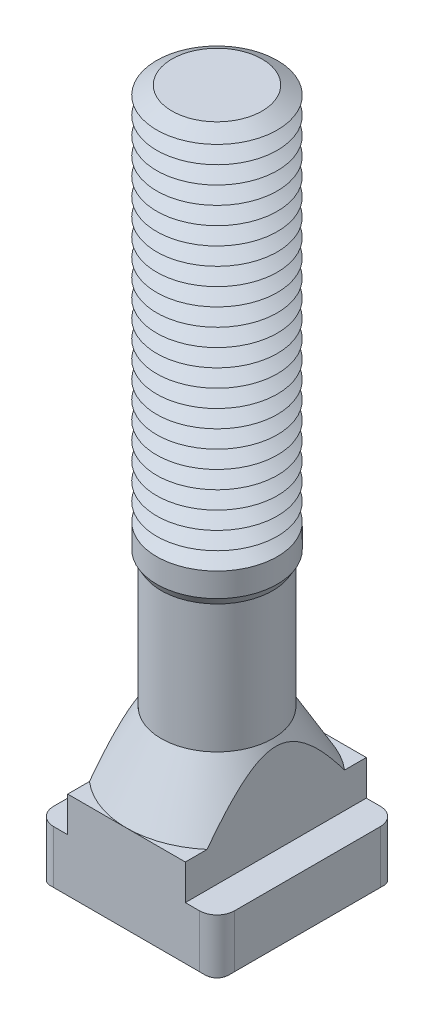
ISO-10303-21;
HEADER;
FILE_DESCRIPTION(('STEP AP214'),'2;1');
FILE_NAME('part.step','',(''),(''),'','','');
FILE_SCHEMA(('AUTOMOTIVE_DESIGN { 1 0 10303 214 1 1 1 1 }'));
ENDSEC;
DATA;
#1=APPLICATION_CONTEXT('core data for automotive mechanical design processes');
#2=APPLICATION_PROTOCOL_DEFINITION('international standard','automotive_design',2000,#1);
#3=PRODUCT_CONTEXT('',#1,'mechanical');
#4=PRODUCT('Part','Part','',(#3));
#5=PRODUCT_RELATED_PRODUCT_CATEGORY('part','',(#4));
#6=PRODUCT_DEFINITION_FORMATION('','',#4);
#7=PRODUCT_DEFINITION_CONTEXT('part definition',#1,'design');
#8=PRODUCT_DEFINITION('design','',#6,#7);
#9=PRODUCT_DEFINITION_SHAPE('','',#8);
#10=(LENGTH_UNIT() NAMED_UNIT(*) SI_UNIT(.MILLI.,.METRE.));
#11=(NAMED_UNIT(*) PLANE_ANGLE_UNIT() SI_UNIT($,.RADIAN.));
#12=(NAMED_UNIT(*) SI_UNIT($,.STERADIAN.) SOLID_ANGLE_UNIT());
#13=UNCERTAINTY_MEASURE_WITH_UNIT(LENGTH_MEASURE(1.E-05),#10,'distance_accuracy_value','');
#14=(GEOMETRIC_REPRESENTATION_CONTEXT(3) GLOBAL_UNCERTAINTY_ASSIGNED_CONTEXT((#13)) GLOBAL_UNIT_ASSIGNED_CONTEXT((#10,
#11,#12)) REPRESENTATION_CONTEXT('',''));
#15=CARTESIAN_POINT('',(0.,0.,0.));
#16=DIRECTION('',(0.,0.,1.));
#17=DIRECTION('',(1.,0.,0.));
#18=AXIS2_PLACEMENT_3D('',#15,#16,#17);
#19=CARTESIAN_POINT('',(0.,63.,0.));
#20=DIRECTION('',(0.,-1.,0.));
#21=DIRECTION('',(0.,0.,-1.));
#22=AXIS2_PLACEMENT_3D('',#19,#20,#21);
#23=CONICAL_SURFACE('',#22,4.48445554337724,1.0471975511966);
#24=CARTESIAN_POINT('',(0.,62.125,0.));
#25=DIRECTION('',(0.,-1.,0.));
#26=DIRECTION('',(0.,0.,-1.));
#27=AXIS2_PLACEMENT_3D('',#24,#25,#26);
#28=CIRCLE('',#27,6.00000000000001);
#29=CARTESIAN_POINT('',(0.,62.125,-6.00000000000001));
#30=VERTEX_POINT('',#29);
#31=EDGE_CURVE('E660',#30,#30,#28,.T.);
#32=ORIENTED_EDGE('',*,*,#31,.F.);
#33=EDGE_LOOP('',(#32));
#34=FACE_BOUND('',#33,.T.);
#35=CARTESIAN_POINT('',(0.,63.,0.));
#36=DIRECTION('',(0.,-1.,0.));
#37=DIRECTION('',(0.,0.,-1.));
#38=AXIS2_PLACEMENT_3D('',#35,#36,#37);
#39=CIRCLE('',#38,4.48445554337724);
#40=CARTESIAN_POINT('',(0.,63.,-4.48445554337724));
#41=VERTEX_POINT('',#40);
#42=EDGE_CURVE('E650',#41,#41,#39,.T.);
#43=ORIENTED_EDGE('',*,*,#42,.T.);
#44=EDGE_LOOP('',(#43));
#45=FACE_BOUND('',#44,.T.);
#46=ADVANCED_FACE('F39',(#34,#45),#23,.T.);
#47=CARTESIAN_POINT('',(0.,63.875,0.));
#48=DIRECTION('',(0.,1.,0.));
#49=DIRECTION('',(0.,0.,1.));
#50=AXIS2_PLACEMENT_3D('',#47,#48,#49);
#51=CONICAL_SURFACE('',#50,6.00000000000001,1.0471975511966);
#52=ORIENTED_EDGE('',*,*,#42,.F.);
#53=EDGE_LOOP('',(#52));
#54=FACE_BOUND('',#53,.T.);
#55=CARTESIAN_POINT('',(0.,63.875,0.));
#56=DIRECTION('',(0.,-1.,0.));
#57=DIRECTION('',(0.,0.,-1.));
#58=AXIS2_PLACEMENT_3D('',#55,#56,#57);
#59=CIRCLE('',#58,6.00000000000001);
#60=CARTESIAN_POINT('',(0.,63.875,-6.00000000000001));
#61=VERTEX_POINT('',#60);
#62=EDGE_CURVE('E647',#61,#61,#59,.T.);
#63=ORIENTED_EDGE('',*,*,#62,.T.);
#64=EDGE_LOOP('',(#63));
#65=FACE_BOUND('',#64,.T.);
#66=ADVANCED_FACE('F449',(#54,#65),#51,.T.);
#67=CARTESIAN_POINT('',(2.99863867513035,70.,0.));
#68=DIRECTION('',(0.,-1.,0.));
#69=DIRECTION('',(1.,0.,0.));
#70=AXIS2_PLACEMENT_3D('',#67,#68,#69);
#71=PLANE('',#70);
#72=CARTESIAN_POINT('',(0.,70.,0.));
#73=DIRECTION('',(0.,-1.,0.));
#74=DIRECTION('',(0.,0.,-1.));
#75=AXIS2_PLACEMENT_3D('',#72,#73,#74);
#76=CIRCLE('',#75,4.48445554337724);
#77=CARTESIAN_POINT('',(0.,70.,-4.48445554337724));
#78=VERTEX_POINT('',#77);
#79=EDGE_CURVE('E642',#78,#78,#76,.T.);
#80=ORIENTED_EDGE('',*,*,#79,.F.);
#81=EDGE_LOOP('',(#80));
#82=FACE_BOUND('',#81,.T.);
#83=ADVANCED_FACE('F455',(#82),#71,.F.);
#84=CARTESIAN_POINT('',(0.,70.,0.));
#85=DIRECTION('',(0.,-1.,0.));
#86=DIRECTION('',(0.,0.,-1.));
#87=AXIS2_PLACEMENT_3D('',#84,#85,#86);
#88=CONICAL_SURFACE('',#87,4.48445554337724,1.0471975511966);
#89=CARTESIAN_POINT('',(0.,69.125,0.));
#90=DIRECTION('',(0.,-1.,0.));
#91=DIRECTION('',(0.,0.,-1.));
#92=AXIS2_PLACEMENT_3D('',#89,#90,#91);
#93=CIRCLE('',#92,6.00000000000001);
#94=CARTESIAN_POINT('',(0.,69.125,-6.00000000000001));
#95=VERTEX_POINT('',#94);
#96=EDGE_CURVE('E645',#95,#95,#93,.T.);
#97=ORIENTED_EDGE('',*,*,#96,.F.);
#98=EDGE_LOOP('',(#97));
#99=FACE_BOUND('',#98,.T.);
#100=ORIENTED_EDGE('',*,*,#79,.T.);
#101=EDGE_LOOP('',(#100));
#102=FACE_BOUND('',#101,.T.);
#103=ADVANCED_FACE('F483',(#99,#102),#88,.T.);
#104=CARTESIAN_POINT('',(0.,69.125,0.));
#105=DIRECTION('',(0.,1.,0.));
#106=DIRECTION('',(0.,0.,1.));
#107=AXIS2_PLACEMENT_3D('',#104,#105,#106);
#108=CONICAL_SURFACE('',#107,6.00000000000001,1.0471975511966);
#109=CARTESIAN_POINT('',(0.,68.25,0.));
#110=DIRECTION('',(0.,-1.,0.));
#111=DIRECTION('',(0.,0.,-1.));
#112=AXIS2_PLACEMENT_3D('',#109,#110,#111);
#113=CIRCLE('',#112,4.48445554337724);
#114=CARTESIAN_POINT('',(0.,68.25,-4.48445554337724));
#115=VERTEX_POINT('',#114);
#116=EDGE_CURVE('E673',#115,#115,#113,.T.);
#117=ORIENTED_EDGE('',*,*,#116,.F.);
#118=EDGE_LOOP('',(#117));
#119=FACE_BOUND('',#118,.T.);
#120=ORIENTED_EDGE('',*,*,#96,.T.);
#121=EDGE_LOOP('',(#120));
#122=FACE_BOUND('',#121,.T.);
#123=ADVANCED_FACE('F480',(#119,#122),#108,.T.);
#124=CARTESIAN_POINT('',(0.,68.25,0.));
#125=DIRECTION('',(0.,-1.,0.));
#126=DIRECTION('',(0.,0.,-1.));
#127=AXIS2_PLACEMENT_3D('',#124,#125,#126);
#128=CONICAL_SURFACE('',#127,4.48445554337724,1.0471975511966);
#129=CARTESIAN_POINT('',(0.,67.375,0.));
#130=DIRECTION('',(0.,-1.,0.));
#131=DIRECTION('',(0.,0.,-1.));
#132=AXIS2_PLACEMENT_3D('',#129,#130,#131);
#133=CIRCLE('',#132,6.00000000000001);
#134=CARTESIAN_POINT('',(0.,67.375,-6.00000000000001));
#135=VERTEX_POINT('',#134);
#136=EDGE_CURVE('E633',#135,#135,#133,.T.);
#137=ORIENTED_EDGE('',*,*,#136,.F.);
#138=EDGE_LOOP('',(#137));
#139=FACE_BOUND('',#138,.T.);
#140=ORIENTED_EDGE('',*,*,#116,.T.);
#141=EDGE_LOOP('',(#140));
#142=FACE_BOUND('',#141,.T.);
#143=ADVANCED_FACE('F475',(#139,#142),#128,.T.);
#144=CARTESIAN_POINT('',(0.,67.375,0.));
#145=DIRECTION('',(0.,1.,0.));
#146=DIRECTION('',(0.,0.,1.));
#147=AXIS2_PLACEMENT_3D('',#144,#145,#146);
#148=CONICAL_SURFACE('',#147,6.00000000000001,1.0471975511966);
#149=CARTESIAN_POINT('',(0.,66.5,0.));
#150=DIRECTION('',(0.,-1.,0.));
#151=DIRECTION('',(0.,0.,-1.));
#152=AXIS2_PLACEMENT_3D('',#149,#150,#151);
#153=CIRCLE('',#152,4.48445554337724);
#154=CARTESIAN_POINT('',(0.,66.5,-4.48445554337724));
#155=VERTEX_POINT('',#154);
#156=EDGE_CURVE('E667',#155,#155,#153,.T.);
#157=ORIENTED_EDGE('',*,*,#156,.F.);
#158=EDGE_LOOP('',(#157));
#159=FACE_BOUND('',#158,.T.);
#160=ORIENTED_EDGE('',*,*,#136,.T.);
#161=EDGE_LOOP('',(#160));
#162=FACE_BOUND('',#161,.T.);
#163=ADVANCED_FACE('F472',(#159,#162),#148,.T.);
#164=CARTESIAN_POINT('',(0.,66.5,0.));
#165=DIRECTION('',(0.,-1.,0.));
#166=DIRECTION('',(0.,0.,-1.));
#167=AXIS2_PLACEMENT_3D('',#164,#165,#166);
#168=CONICAL_SURFACE('',#167,4.48445554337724,1.0471975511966);
#169=CARTESIAN_POINT('',(0.,65.625,0.));
#170=DIRECTION('',(0.,-1.,0.));
#171=DIRECTION('',(0.,0.,-1.));
#172=AXIS2_PLACEMENT_3D('',#169,#170,#171);
#173=CIRCLE('',#172,6.00000000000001);
#174=CARTESIAN_POINT('',(0.,65.625,-6.00000000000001));
#175=VERTEX_POINT('',#174);
#176=EDGE_CURVE('E656',#175,#175,#173,.T.);
#177=ORIENTED_EDGE('',*,*,#176,.F.);
#178=EDGE_LOOP('',(#177));
#179=FACE_BOUND('',#178,.T.);
#180=ORIENTED_EDGE('',*,*,#156,.T.);
#181=EDGE_LOOP('',(#180));
#182=FACE_BOUND('',#181,.T.);
#183=ADVANCED_FACE('F466',(#179,#182),#168,.T.);
#184=CARTESIAN_POINT('',(0.,65.625,0.));
#185=DIRECTION('',(0.,1.,0.));
#186=DIRECTION('',(0.,0.,1.));
#187=AXIS2_PLACEMENT_3D('',#184,#185,#186);
#188=CONICAL_SURFACE('',#187,6.00000000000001,1.0471975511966);
#189=CARTESIAN_POINT('',(0.,64.75,0.));
#190=DIRECTION('',(0.,-1.,0.));
#191=DIRECTION('',(0.,0.,-1.));
#192=AXIS2_PLACEMENT_3D('',#189,#190,#191);
#193=CIRCLE('',#192,4.48445554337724);
#194=CARTESIAN_POINT('',(0.,64.75,-4.48445554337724));
#195=VERTEX_POINT('',#194);
#196=EDGE_CURVE('E649',#195,#195,#193,.T.);
#197=ORIENTED_EDGE('',*,*,#196,.F.);
#198=EDGE_LOOP('',(#197));
#199=FACE_BOUND('',#198,.T.);
#200=ORIENTED_EDGE('',*,*,#176,.T.);
#201=EDGE_LOOP('',(#200));
#202=FACE_BOUND('',#201,.T.);
#203=ADVANCED_FACE('F462',(#199,#202),#188,.T.);
#204=CARTESIAN_POINT('',(0.,64.75,0.));
#205=DIRECTION('',(0.,-1.,0.));
#206=DIRECTION('',(0.,0.,-1.));
#207=AXIS2_PLACEMENT_3D('',#204,#205,#206);
#208=CONICAL_SURFACE('',#207,4.48445554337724,1.0471975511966);
#209=ORIENTED_EDGE('',*,*,#62,.F.);
#210=EDGE_LOOP('',(#209));
#211=FACE_BOUND('',#210,.T.);
#212=ORIENTED_EDGE('',*,*,#196,.T.);
#213=EDGE_LOOP('',(#212));
#214=FACE_BOUND('',#213,.T.);
#215=ADVANCED_FACE('F465',(#211,#214),#208,.T.);
#216=CARTESIAN_POINT('',(0.,61.25,0.));
#217=DIRECTION('',(0.,-1.,0.));
#218=DIRECTION('',(0.,0.,-1.));
#219=AXIS2_PLACEMENT_3D('',#216,#217,#218);
#220=CONICAL_SURFACE('',#219,4.48445554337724,1.0471975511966);
#221=CARTESIAN_POINT('',(0.,60.375,0.));
#222=DIRECTION('',(0.,-1.,0.));
#223=DIRECTION('',(0.,0.,-1.));
#224=AXIS2_PLACEMENT_3D('',#221,#222,#223);
#225=CIRCLE('',#224,6.00000000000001);
#226=CARTESIAN_POINT('',(0.,60.375,-6.00000000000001));
#227=VERTEX_POINT('',#226);
#228=EDGE_CURVE('E746',#227,#227,#225,.T.);
#229=ORIENTED_EDGE('',*,*,#228,.F.);
#230=EDGE_LOOP('',(#229));
#231=FACE_BOUND('',#230,.T.);
#232=CARTESIAN_POINT('',(0.,61.25,0.));
#233=DIRECTION('',(0.,-1.,0.));
#234=DIRECTION('',(0.,0.,-1.));
#235=AXIS2_PLACEMENT_3D('',#232,#233,#234);
#236=CIRCLE('',#235,4.48445554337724);
#237=CARTESIAN_POINT('',(0.,61.25,-4.48445554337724));
#238=VERTEX_POINT('',#237);
#239=EDGE_CURVE('E744',#238,#238,#236,.T.);
#240=ORIENTED_EDGE('',*,*,#239,.T.);
#241=EDGE_LOOP('',(#240));
#242=FACE_BOUND('',#241,.T.);
#243=ADVANCED_FACE('F470',(#231,#242),#220,.T.);
#244=CARTESIAN_POINT('',(0.,62.125,0.));
#245=DIRECTION('',(0.,1.,0.));
#246=DIRECTION('',(0.,0.,1.));
#247=AXIS2_PLACEMENT_3D('',#244,#245,#246);
#248=CONICAL_SURFACE('',#247,6.00000000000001,1.0471975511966);
#249=ORIENTED_EDGE('',*,*,#239,.F.);
#250=EDGE_LOOP('',(#249));
#251=FACE_BOUND('',#250,.T.);
#252=ORIENTED_EDGE('',*,*,#31,.T.);
#253=EDGE_LOOP('',(#252));
#254=FACE_BOUND('',#253,.T.);
#255=ADVANCED_FACE('F998',(#251,#254),#248,.T.);
#256=CARTESIAN_POINT('',(0.,59.5,0.));
#257=DIRECTION('',(0.,-1.,0.));
#258=DIRECTION('',(0.,0.,-1.));
#259=AXIS2_PLACEMENT_3D('',#256,#257,#258);
#260=CONICAL_SURFACE('',#259,4.48445554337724,1.0471975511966);
#261=CARTESIAN_POINT('',(0.,58.625,0.));
#262=DIRECTION('',(0.,-1.,0.));
#263=DIRECTION('',(0.,0.,-1.));
#264=AXIS2_PLACEMENT_3D('',#261,#262,#263);
#265=CIRCLE('',#264,6.00000000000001);
#266=CARTESIAN_POINT('',(0.,58.625,-6.00000000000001));
#267=VERTEX_POINT('',#266);
#268=EDGE_CURVE('E726',#267,#267,#265,.T.);
#269=ORIENTED_EDGE('',*,*,#268,.F.);
#270=EDGE_LOOP('',(#269));
#271=FACE_BOUND('',#270,.T.);
#272=CARTESIAN_POINT('',(0.,59.5,0.));
#273=DIRECTION('',(0.,-1.,0.));
#274=DIRECTION('',(0.,0.,-1.));
#275=AXIS2_PLACEMENT_3D('',#272,#273,#274);
#276=CIRCLE('',#275,4.48445554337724);
#277=CARTESIAN_POINT('',(0.,59.5,-4.48445554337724));
#278=VERTEX_POINT('',#277);
#279=EDGE_CURVE('E729',#278,#278,#276,.T.);
#280=ORIENTED_EDGE('',*,*,#279,.T.);
#281=EDGE_LOOP('',(#280));
#282=FACE_BOUND('',#281,.T.);
#283=ADVANCED_FACE('F995',(#271,#282),#260,.T.);
#284=CARTESIAN_POINT('',(0.,60.375,0.));
#285=DIRECTION('',(0.,1.,0.));
#286=DIRECTION('',(0.,0.,1.));
#287=AXIS2_PLACEMENT_3D('',#284,#285,#286);
#288=CONICAL_SURFACE('',#287,6.00000000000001,1.0471975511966);
#289=ORIENTED_EDGE('',*,*,#279,.F.);
#290=EDGE_LOOP('',(#289));
#291=FACE_BOUND('',#290,.T.);
#292=ORIENTED_EDGE('',*,*,#228,.T.);
#293=EDGE_LOOP('',(#292));
#294=FACE_BOUND('',#293,.T.);
#295=ADVANCED_FACE('F986',(#291,#294),#288,.T.);
#296=CARTESIAN_POINT('',(0.,57.75,0.));
#297=DIRECTION('',(0.,-1.,0.));
#298=DIRECTION('',(0.,0.,-1.));
#299=AXIS2_PLACEMENT_3D('',#296,#297,#298);
#300=CONICAL_SURFACE('',#299,4.48445554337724,1.0471975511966);
#301=CARTESIAN_POINT('',(0.,56.875,0.));
#302=DIRECTION('',(0.,-1.,0.));
#303=DIRECTION('',(0.,0.,-1.));
#304=AXIS2_PLACEMENT_3D('',#301,#302,#303);
#305=CIRCLE('',#304,6.00000000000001);
#306=CARTESIAN_POINT('',(0.,56.875,-6.00000000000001));
#307=VERTEX_POINT('',#306);
#308=EDGE_CURVE('E639',#307,#307,#305,.T.);
#309=ORIENTED_EDGE('',*,*,#308,.F.);
#310=EDGE_LOOP('',(#309));
#311=FACE_BOUND('',#310,.T.);
#312=CARTESIAN_POINT('',(0.,57.75,0.));
#313=DIRECTION('',(0.,-1.,0.));
#314=DIRECTION('',(0.,0.,-1.));
#315=AXIS2_PLACEMENT_3D('',#312,#313,#314);
#316=CIRCLE('',#315,4.48445554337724);
#317=CARTESIAN_POINT('',(0.,57.75,-4.48445554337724));
#318=VERTEX_POINT('',#317);
#319=EDGE_CURVE('E730',#318,#318,#316,.T.);
#320=ORIENTED_EDGE('',*,*,#319,.T.);
#321=EDGE_LOOP('',(#320));
#322=FACE_BOUND('',#321,.T.);
#323=ADVANCED_FACE('F983',(#311,#322),#300,.T.);
#324=CARTESIAN_POINT('',(0.,58.625,0.));
#325=DIRECTION('',(0.,1.,0.));
#326=DIRECTION('',(0.,0.,1.));
#327=AXIS2_PLACEMENT_3D('',#324,#325,#326);
#328=CONICAL_SURFACE('',#327,6.00000000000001,1.0471975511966);
#329=ORIENTED_EDGE('',*,*,#319,.F.);
#330=EDGE_LOOP('',(#329));
#331=FACE_BOUND('',#330,.T.);
#332=ORIENTED_EDGE('',*,*,#268,.T.);
#333=EDGE_LOOP('',(#332));
#334=FACE_BOUND('',#333,.T.);
#335=ADVANCED_FACE('F974',(#331,#334),#328,.T.);
#336=CARTESIAN_POINT('',(0.,56.,0.));
#337=DIRECTION('',(0.,-1.,0.));
#338=DIRECTION('',(0.,0.,-1.));
#339=AXIS2_PLACEMENT_3D('',#336,#337,#338);
#340=CONICAL_SURFACE('',#339,4.48445554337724,1.0471975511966);
#341=CARTESIAN_POINT('',(0.,55.125,0.));
#342=DIRECTION('',(0.,-1.,0.));
#343=DIRECTION('',(0.,0.,-1.));
#344=AXIS2_PLACEMENT_3D('',#341,#342,#343);
#345=CIRCLE('',#344,6.00000000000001);
#346=CARTESIAN_POINT('',(0.,55.125,-6.00000000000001));
#347=VERTEX_POINT('',#346);
#348=EDGE_CURVE('E640',#347,#347,#345,.T.);
#349=ORIENTED_EDGE('',*,*,#348,.F.);
#350=EDGE_LOOP('',(#349));
#351=FACE_BOUND('',#350,.T.);
#352=CARTESIAN_POINT('',(0.,56.,0.));
#353=DIRECTION('',(0.,-1.,0.));
#354=DIRECTION('',(0.,0.,-1.));
#355=AXIS2_PLACEMENT_3D('',#352,#353,#354);
#356=CIRCLE('',#355,4.48445554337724);
#357=CARTESIAN_POINT('',(0.,56.,-4.48445554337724));
#358=VERTEX_POINT('',#357);
#359=EDGE_CURVE('E636',#358,#358,#356,.T.);
#360=ORIENTED_EDGE('',*,*,#359,.T.);
#361=EDGE_LOOP('',(#360));
#362=FACE_BOUND('',#361,.T.);
#363=ADVANCED_FACE('F971',(#351,#362),#340,.T.);
#364=CARTESIAN_POINT('',(0.,56.875,0.));
#365=DIRECTION('',(0.,1.,0.));
#366=DIRECTION('',(0.,0.,1.));
#367=AXIS2_PLACEMENT_3D('',#364,#365,#366);
#368=CONICAL_SURFACE('',#367,6.00000000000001,1.0471975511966);
#369=ORIENTED_EDGE('',*,*,#359,.F.);
#370=EDGE_LOOP('',(#369));
#371=FACE_BOUND('',#370,.T.);
#372=ORIENTED_EDGE('',*,*,#308,.T.);
#373=EDGE_LOOP('',(#372));
#374=FACE_BOUND('',#373,.T.);
#375=ADVANCED_FACE('F962',(#371,#374),#368,.T.);
#376=CARTESIAN_POINT('',(0.,54.25,0.));
#377=DIRECTION('',(0.,-1.,0.));
#378=DIRECTION('',(0.,0.,-1.));
#379=AXIS2_PLACEMENT_3D('',#376,#377,#378);
#380=CONICAL_SURFACE('',#379,4.48445554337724,1.0471975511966);
#381=CARTESIAN_POINT('',(0.,53.375,0.));
#382=DIRECTION('',(0.,-1.,0.));
#383=DIRECTION('',(0.,0.,-1.));
#384=AXIS2_PLACEMENT_3D('',#381,#382,#383);
#385=CIRCLE('',#384,6.00000000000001);
#386=CARTESIAN_POINT('',(0.,53.375,-6.00000000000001));
#387=VERTEX_POINT('',#386);
#388=EDGE_CURVE('E724',#387,#387,#385,.T.);
#389=ORIENTED_EDGE('',*,*,#388,.F.);
#390=EDGE_LOOP('',(#389));
#391=FACE_BOUND('',#390,.T.);
#392=CARTESIAN_POINT('',(0.,54.25,0.));
#393=DIRECTION('',(0.,-1.,0.));
#394=DIRECTION('',(0.,0.,-1.));
#395=AXIS2_PLACEMENT_3D('',#392,#393,#394);
#396=CIRCLE('',#395,4.48445554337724);
#397=CARTESIAN_POINT('',(0.,54.25,-4.48445554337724));
#398=VERTEX_POINT('',#397);
#399=EDGE_CURVE('E709',#398,#398,#396,.T.);
#400=ORIENTED_EDGE('',*,*,#399,.T.);
#401=EDGE_LOOP('',(#400));
#402=FACE_BOUND('',#401,.T.);
#403=ADVANCED_FACE('F959',(#391,#402),#380,.T.);
#404=CARTESIAN_POINT('',(0.,55.125,0.));
#405=DIRECTION('',(0.,1.,0.));
#406=DIRECTION('',(0.,0.,1.));
#407=AXIS2_PLACEMENT_3D('',#404,#405,#406);
#408=CONICAL_SURFACE('',#407,6.00000000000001,1.0471975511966);
#409=ORIENTED_EDGE('',*,*,#399,.F.);
#410=EDGE_LOOP('',(#409));
#411=FACE_BOUND('',#410,.T.);
#412=ORIENTED_EDGE('',*,*,#348,.T.);
#413=EDGE_LOOP('',(#412));
#414=FACE_BOUND('',#413,.T.);
#415=ADVANCED_FACE('F950',(#411,#414),#408,.T.);
#416=CARTESIAN_POINT('',(0.,52.5,0.));
#417=DIRECTION('',(0.,-1.,0.));
#418=DIRECTION('',(0.,0.,-1.));
#419=AXIS2_PLACEMENT_3D('',#416,#417,#418);
#420=CONICAL_SURFACE('',#419,4.48445554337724,1.0471975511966);
#421=CARTESIAN_POINT('',(0.,51.625,0.));
#422=DIRECTION('',(0.,-1.,0.));
#423=DIRECTION('',(0.,0.,-1.));
#424=AXIS2_PLACEMENT_3D('',#421,#422,#423);
#425=CIRCLE('',#424,6.00000000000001);
#426=CARTESIAN_POINT('',(0.,51.625,-6.00000000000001));
#427=VERTEX_POINT('',#426);
#428=EDGE_CURVE('E771',#427,#427,#425,.T.);
#429=ORIENTED_EDGE('',*,*,#428,.F.);
#430=EDGE_LOOP('',(#429));
#431=FACE_BOUND('',#430,.T.);
#432=CARTESIAN_POINT('',(0.,52.5,0.));
#433=DIRECTION('',(0.,-1.,0.));
#434=DIRECTION('',(0.,0.,-1.));
#435=AXIS2_PLACEMENT_3D('',#432,#433,#434);
#436=CIRCLE('',#435,4.48445554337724);
#437=CARTESIAN_POINT('',(0.,52.5,-4.48445554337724));
#438=VERTEX_POINT('',#437);
#439=EDGE_CURVE('E767',#438,#438,#436,.T.);
#440=ORIENTED_EDGE('',*,*,#439,.T.);
#441=EDGE_LOOP('',(#440));
#442=FACE_BOUND('',#441,.T.);
#443=ADVANCED_FACE('F947',(#431,#442),#420,.T.);
#444=CARTESIAN_POINT('',(0.,53.375,0.));
#445=DIRECTION('',(0.,1.,0.));
#446=DIRECTION('',(0.,0.,1.));
#447=AXIS2_PLACEMENT_3D('',#444,#445,#446);
#448=CONICAL_SURFACE('',#447,6.00000000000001,1.0471975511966);
#449=ORIENTED_EDGE('',*,*,#439,.F.);
#450=EDGE_LOOP('',(#449));
#451=FACE_BOUND('',#450,.T.);
#452=ORIENTED_EDGE('',*,*,#388,.T.);
#453=EDGE_LOOP('',(#452));
#454=FACE_BOUND('',#453,.T.);
#455=ADVANCED_FACE('F938',(#451,#454),#448,.T.);
#456=CARTESIAN_POINT('',(0.,50.75,0.));
#457=DIRECTION('',(0.,-1.,0.));
#458=DIRECTION('',(0.,0.,-1.));
#459=AXIS2_PLACEMENT_3D('',#456,#457,#458);
#460=CONICAL_SURFACE('',#459,4.48445554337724,1.0471975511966);
#461=CARTESIAN_POINT('',(0.,49.875,0.));
#462=DIRECTION('',(0.,-1.,0.));
#463=DIRECTION('',(0.,0.,-1.));
#464=AXIS2_PLACEMENT_3D('',#461,#462,#463);
#465=CIRCLE('',#464,6.00000000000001);
#466=CARTESIAN_POINT('',(0.,49.875,-6.00000000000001));
#467=VERTEX_POINT('',#466);
#468=EDGE_CURVE('E693',#467,#467,#465,.T.);
#469=ORIENTED_EDGE('',*,*,#468,.F.);
#470=EDGE_LOOP('',(#469));
#471=FACE_BOUND('',#470,.T.);
#472=CARTESIAN_POINT('',(0.,50.75,0.));
#473=DIRECTION('',(0.,-1.,0.));
#474=DIRECTION('',(0.,0.,-1.));
#475=AXIS2_PLACEMENT_3D('',#472,#473,#474);
#476=CIRCLE('',#475,4.48445554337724);
#477=CARTESIAN_POINT('',(0.,50.75,-4.48445554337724));
#478=VERTEX_POINT('',#477);
#479=EDGE_CURVE('E720',#478,#478,#476,.T.);
#480=ORIENTED_EDGE('',*,*,#479,.T.);
#481=EDGE_LOOP('',(#480));
#482=FACE_BOUND('',#481,.T.);
#483=ADVANCED_FACE('F935',(#471,#482),#460,.T.);
#484=CARTESIAN_POINT('',(0.,51.625,0.));
#485=DIRECTION('',(0.,1.,0.));
#486=DIRECTION('',(0.,0.,1.));
#487=AXIS2_PLACEMENT_3D('',#484,#485,#486);
#488=CONICAL_SURFACE('',#487,6.00000000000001,1.0471975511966);
#489=ORIENTED_EDGE('',*,*,#479,.F.);
#490=EDGE_LOOP('',(#489));
#491=FACE_BOUND('',#490,.T.);
#492=ORIENTED_EDGE('',*,*,#428,.T.);
#493=EDGE_LOOP('',(#492));
#494=FACE_BOUND('',#493,.T.);
#495=ADVANCED_FACE('F926',(#491,#494),#488,.T.);
#496=CARTESIAN_POINT('',(0.,49.,0.));
#497=DIRECTION('',(0.,-1.,0.));
#498=DIRECTION('',(0.,0.,-1.));
#499=AXIS2_PLACEMENT_3D('',#496,#497,#498);
#500=CONICAL_SURFACE('',#499,4.48445554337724,1.0471975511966);
#501=CARTESIAN_POINT('',(0.,48.125,0.));
#502=DIRECTION('',(0.,-1.,0.));
#503=DIRECTION('',(0.,0.,-1.));
#504=AXIS2_PLACEMENT_3D('',#501,#502,#503);
#505=CIRCLE('',#504,6.00000000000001);
#506=CARTESIAN_POINT('',(0.,48.125,-6.00000000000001));
#507=VERTEX_POINT('',#506);
#508=EDGE_CURVE('E694',#507,#507,#505,.T.);
#509=ORIENTED_EDGE('',*,*,#508,.F.);
#510=EDGE_LOOP('',(#509));
#511=FACE_BOUND('',#510,.T.);
#512=CARTESIAN_POINT('',(0.,49.,0.));
#513=DIRECTION('',(0.,-1.,0.));
#514=DIRECTION('',(0.,0.,-1.));
#515=AXIS2_PLACEMENT_3D('',#512,#513,#514);
#516=CIRCLE('',#515,4.48445554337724);
#517=CARTESIAN_POINT('',(0.,49.,-4.48445554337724));
#518=VERTEX_POINT('',#517);
#519=EDGE_CURVE('E691',#518,#518,#516,.T.);
#520=ORIENTED_EDGE('',*,*,#519,.T.);
#521=EDGE_LOOP('',(#520));
#522=FACE_BOUND('',#521,.T.);
#523=ADVANCED_FACE('F923',(#511,#522),#500,.T.);
#524=CARTESIAN_POINT('',(0.,49.875,0.));
#525=DIRECTION('',(0.,1.,0.));
#526=DIRECTION('',(0.,0.,1.));
#527=AXIS2_PLACEMENT_3D('',#524,#525,#526);
#528=CONICAL_SURFACE('',#527,6.00000000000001,1.0471975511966);
#529=ORIENTED_EDGE('',*,*,#519,.F.);
#530=EDGE_LOOP('',(#529));
#531=FACE_BOUND('',#530,.T.);
#532=ORIENTED_EDGE('',*,*,#468,.T.);
#533=EDGE_LOOP('',(#532));
#534=FACE_BOUND('',#533,.T.);
#535=ADVANCED_FACE('F914',(#531,#534),#528,.T.);
#536=CARTESIAN_POINT('',(0.,47.25,0.));
#537=DIRECTION('',(0.,-1.,0.));
#538=DIRECTION('',(0.,0.,-1.));
#539=AXIS2_PLACEMENT_3D('',#536,#537,#538);
#540=CONICAL_SURFACE('',#539,4.48445554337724,1.0471975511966);
#541=CARTESIAN_POINT('',(0.,46.375,0.));
#542=DIRECTION('',(0.,-1.,0.));
#543=DIRECTION('',(0.,0.,-1.));
#544=AXIS2_PLACEMENT_3D('',#541,#542,#543);
#545=CIRCLE('',#544,6.00000000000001);
#546=CARTESIAN_POINT('',(0.,46.375,-6.00000000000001));
#547=VERTEX_POINT('',#546);
#548=EDGE_CURVE('E738',#547,#547,#545,.T.);
#549=ORIENTED_EDGE('',*,*,#548,.F.);
#550=EDGE_LOOP('',(#549));
#551=FACE_BOUND('',#550,.T.);
#552=CARTESIAN_POINT('',(0.,47.25,0.));
#553=DIRECTION('',(0.,-1.,0.));
#554=DIRECTION('',(0.,0.,-1.));
#555=AXIS2_PLACEMENT_3D('',#552,#553,#554);
#556=CIRCLE('',#555,4.48445554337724);
#557=CARTESIAN_POINT('',(0.,47.25,-4.48445554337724));
#558=VERTEX_POINT('',#557);
#559=EDGE_CURVE('E740',#558,#558,#556,.T.);
#560=ORIENTED_EDGE('',*,*,#559,.T.);
#561=EDGE_LOOP('',(#560));
#562=FACE_BOUND('',#561,.T.);
#563=ADVANCED_FACE('F911',(#551,#562),#540,.T.);
#564=CARTESIAN_POINT('',(0.,48.125,0.));
#565=DIRECTION('',(0.,1.,0.));
#566=DIRECTION('',(0.,0.,1.));
#567=AXIS2_PLACEMENT_3D('',#564,#565,#566);
#568=CONICAL_SURFACE('',#567,6.00000000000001,1.0471975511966);
#569=ORIENTED_EDGE('',*,*,#559,.F.);
#570=EDGE_LOOP('',(#569));
#571=FACE_BOUND('',#570,.T.);
#572=ORIENTED_EDGE('',*,*,#508,.T.);
#573=EDGE_LOOP('',(#572));
#574=FACE_BOUND('',#573,.T.);
#575=ADVANCED_FACE('F902',(#571,#574),#568,.T.);
#576=CARTESIAN_POINT('',(0.,45.5,0.));
#577=DIRECTION('',(0.,-1.,0.));
#578=DIRECTION('',(0.,0.,-1.));
#579=AXIS2_PLACEMENT_3D('',#576,#577,#578);
#580=CONICAL_SURFACE('',#579,4.48445554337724,1.0471975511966);
#581=CARTESIAN_POINT('',(0.,44.625,0.));
#582=DIRECTION('',(0.,-1.,0.));
#583=DIRECTION('',(0.,0.,-1.));
#584=AXIS2_PLACEMENT_3D('',#581,#582,#583);
#585=CIRCLE('',#584,6.00000000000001);
#586=CARTESIAN_POINT('',(0.,44.625,-6.00000000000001));
#587=VERTEX_POINT('',#586);
#588=EDGE_CURVE('E715',#587,#587,#585,.T.);
#589=ORIENTED_EDGE('',*,*,#588,.F.);
#590=EDGE_LOOP('',(#589));
#591=FACE_BOUND('',#590,.T.);
#592=CARTESIAN_POINT('',(0.,45.5,0.));
#593=DIRECTION('',(0.,-1.,0.));
#594=DIRECTION('',(0.,0.,-1.));
#595=AXIS2_PLACEMENT_3D('',#592,#593,#594);
#596=CIRCLE('',#595,4.48445554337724);
#597=CARTESIAN_POINT('',(0.,45.5,-4.48445554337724));
#598=VERTEX_POINT('',#597);
#599=EDGE_CURVE('E735',#598,#598,#596,.T.);
#600=ORIENTED_EDGE('',*,*,#599,.T.);
#601=EDGE_LOOP('',(#600));
#602=FACE_BOUND('',#601,.T.);
#603=ADVANCED_FACE('F899',(#591,#602),#580,.T.);
#604=CARTESIAN_POINT('',(0.,46.375,0.));
#605=DIRECTION('',(0.,1.,0.));
#606=DIRECTION('',(0.,0.,1.));
#607=AXIS2_PLACEMENT_3D('',#604,#605,#606);
#608=CONICAL_SURFACE('',#607,6.00000000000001,1.0471975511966);
#609=ORIENTED_EDGE('',*,*,#599,.F.);
#610=EDGE_LOOP('',(#609));
#611=FACE_BOUND('',#610,.T.);
#612=ORIENTED_EDGE('',*,*,#548,.T.);
#613=EDGE_LOOP('',(#612));
#614=FACE_BOUND('',#613,.T.);
#615=ADVANCED_FACE('F890',(#611,#614),#608,.T.);
#616=CARTESIAN_POINT('',(0.,43.75,0.));
#617=DIRECTION('',(0.,-1.,0.));
#618=DIRECTION('',(0.,0.,-1.));
#619=AXIS2_PLACEMENT_3D('',#616,#617,#618);
#620=CONICAL_SURFACE('',#619,4.48445554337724,1.0471975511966);
#621=CARTESIAN_POINT('',(0.,42.875,0.));
#622=DIRECTION('',(0.,-1.,0.));
#623=DIRECTION('',(0.,0.,-1.));
#624=AXIS2_PLACEMENT_3D('',#621,#622,#623);
#625=CIRCLE('',#624,6.00000000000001);
#626=CARTESIAN_POINT('',(0.,42.875,-6.00000000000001));
#627=VERTEX_POINT('',#626);
#628=EDGE_CURVE('E716',#627,#627,#625,.T.);
#629=ORIENTED_EDGE('',*,*,#628,.F.);
#630=EDGE_LOOP('',(#629));
#631=FACE_BOUND('',#630,.T.);
#632=CARTESIAN_POINT('',(0.,43.75,0.));
#633=DIRECTION('',(0.,-1.,0.));
#634=DIRECTION('',(0.,0.,-1.));
#635=AXIS2_PLACEMENT_3D('',#632,#633,#634);
#636=CIRCLE('',#635,4.48445554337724);
#637=CARTESIAN_POINT('',(0.,43.75,-4.48445554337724));
#638=VERTEX_POINT('',#637);
#639=EDGE_CURVE('E712',#638,#638,#636,.T.);
#640=ORIENTED_EDGE('',*,*,#639,.T.);
#641=EDGE_LOOP('',(#640));
#642=FACE_BOUND('',#641,.T.);
#643=ADVANCED_FACE('F887',(#631,#642),#620,.T.);
#644=CARTESIAN_POINT('',(0.,44.625,0.));
#645=DIRECTION('',(0.,1.,0.));
#646=DIRECTION('',(0.,0.,1.));
#647=AXIS2_PLACEMENT_3D('',#644,#645,#646);
#648=CONICAL_SURFACE('',#647,6.00000000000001,1.0471975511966);
#649=ORIENTED_EDGE('',*,*,#639,.F.);
#650=EDGE_LOOP('',(#649));
#651=FACE_BOUND('',#650,.T.);
#652=ORIENTED_EDGE('',*,*,#588,.T.);
#653=EDGE_LOOP('',(#652));
#654=FACE_BOUND('',#653,.T.);
#655=ADVANCED_FACE('F878',(#651,#654),#648,.T.);
#656=CARTESIAN_POINT('',(0.,42.,0.));
#657=DIRECTION('',(0.,-1.,0.));
#658=DIRECTION('',(0.,0.,-1.));
#659=AXIS2_PLACEMENT_3D('',#656,#657,#658);
#660=CONICAL_SURFACE('',#659,4.48445554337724,1.0471975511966);
#661=CARTESIAN_POINT('',(0.,41.125,0.));
#662=DIRECTION('',(0.,-1.,0.));
#663=DIRECTION('',(0.,0.,-1.));
#664=AXIS2_PLACEMENT_3D('',#661,#662,#663);
#665=CIRCLE('',#664,6.00000000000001);
#666=CARTESIAN_POINT('',(0.,41.125,-6.00000000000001));
#667=VERTEX_POINT('',#666);
#668=EDGE_CURVE('E697',#667,#667,#665,.T.);
#669=ORIENTED_EDGE('',*,*,#668,.F.);
#670=EDGE_LOOP('',(#669));
#671=FACE_BOUND('',#670,.T.);
#672=CARTESIAN_POINT('',(0.,42.,0.));
#673=DIRECTION('',(0.,-1.,0.));
#674=DIRECTION('',(0.,0.,-1.));
#675=AXIS2_PLACEMENT_3D('',#672,#673,#674);
#676=CIRCLE('',#675,4.48445554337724);
#677=CARTESIAN_POINT('',(0.,42.,-4.48445554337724));
#678=VERTEX_POINT('',#677);
#679=EDGE_CURVE('E699',#678,#678,#676,.T.);
#680=ORIENTED_EDGE('',*,*,#679,.T.);
#681=EDGE_LOOP('',(#680));
#682=FACE_BOUND('',#681,.T.);
#683=ADVANCED_FACE('F875',(#671,#682),#660,.T.);
#684=CARTESIAN_POINT('',(0.,42.875,0.));
#685=DIRECTION('',(0.,1.,0.));
#686=DIRECTION('',(0.,0.,1.));
#687=AXIS2_PLACEMENT_3D('',#684,#685,#686);
#688=CONICAL_SURFACE('',#687,6.00000000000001,1.0471975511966);
#689=ORIENTED_EDGE('',*,*,#679,.F.);
#690=EDGE_LOOP('',(#689));
#691=FACE_BOUND('',#690,.T.);
#692=ORIENTED_EDGE('',*,*,#628,.T.);
#693=EDGE_LOOP('',(#692));
#694=FACE_BOUND('',#693,.T.);
#695=ADVANCED_FACE('F866',(#691,#694),#688,.T.);
#696=CARTESIAN_POINT('',(0.,40.25,0.));
#697=DIRECTION('',(0.,-1.,0.));
#698=DIRECTION('',(0.,0.,-1.));
#699=AXIS2_PLACEMENT_3D('',#696,#697,#698);
#700=CONICAL_SURFACE('',#699,4.48445554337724,1.0471975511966);
#701=CARTESIAN_POINT('',(0.,39.375,0.));
#702=DIRECTION('',(0.,-1.,0.));
#703=DIRECTION('',(0.,0.,-1.));
#704=AXIS2_PLACEMENT_3D('',#701,#702,#703);
#705=CIRCLE('',#704,6.00000000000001);
#706=CARTESIAN_POINT('',(0.,39.375,-6.00000000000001));
#707=VERTEX_POINT('',#706);
#708=EDGE_CURVE('E793',#707,#707,#705,.T.);
#709=ORIENTED_EDGE('',*,*,#708,.F.);
#710=EDGE_LOOP('',(#709));
#711=FACE_BOUND('',#710,.T.);
#712=CARTESIAN_POINT('',(0.,40.25,0.));
#713=DIRECTION('',(0.,-1.,0.));
#714=DIRECTION('',(0.,0.,-1.));
#715=AXIS2_PLACEMENT_3D('',#712,#713,#714);
#716=CIRCLE('',#715,4.48445554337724);
#717=CARTESIAN_POINT('',(0.,40.25,-4.48445554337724));
#718=VERTEX_POINT('',#717);
#719=EDGE_CURVE('E700',#718,#718,#716,.T.);
#720=ORIENTED_EDGE('',*,*,#719,.T.);
#721=EDGE_LOOP('',(#720));
#722=FACE_BOUND('',#721,.T.);
#723=ADVANCED_FACE('F863',(#711,#722),#700,.T.);
#724=CARTESIAN_POINT('',(0.,41.125,0.));
#725=DIRECTION('',(0.,1.,0.));
#726=DIRECTION('',(0.,0.,1.));
#727=AXIS2_PLACEMENT_3D('',#724,#725,#726);
#728=CONICAL_SURFACE('',#727,6.00000000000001,1.0471975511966);
#729=ORIENTED_EDGE('',*,*,#719,.F.);
#730=EDGE_LOOP('',(#729));
#731=FACE_BOUND('',#730,.T.);
#732=ORIENTED_EDGE('',*,*,#668,.T.);
#733=EDGE_LOOP('',(#732));
#734=FACE_BOUND('',#733,.T.);
#735=ADVANCED_FACE('F854',(#731,#734),#728,.T.);
#736=CARTESIAN_POINT('',(0.,38.5,0.));
#737=DIRECTION('',(0.,-1.,0.));
#738=DIRECTION('',(0.,0.,-1.));
#739=AXIS2_PLACEMENT_3D('',#736,#737,#738);
#740=CONICAL_SURFACE('',#739,4.48445554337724,1.0471975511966);
#741=CARTESIAN_POINT('',(0.,37.625,0.));
#742=DIRECTION('',(0.,-1.,0.));
#743=DIRECTION('',(0.,0.,-1.));
#744=AXIS2_PLACEMENT_3D('',#741,#742,#743);
#745=CIRCLE('',#744,6.00000000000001);
#746=CARTESIAN_POINT('',(0.,37.625,-6.00000000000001));
#747=VERTEX_POINT('',#746);
#748=EDGE_CURVE('E801',#747,#747,#745,.T.);
#749=ORIENTED_EDGE('',*,*,#748,.F.);
#750=EDGE_LOOP('',(#749));
#751=FACE_BOUND('',#750,.T.);
#752=CARTESIAN_POINT('',(0.,38.5,0.));
#753=DIRECTION('',(0.,-1.,0.));
#754=DIRECTION('',(0.,0.,-1.));
#755=AXIS2_PLACEMENT_3D('',#752,#753,#754);
#756=CIRCLE('',#755,4.48445554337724);
#757=CARTESIAN_POINT('',(0.,38.5,-4.48445554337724));
#758=VERTEX_POINT('',#757);
#759=EDGE_CURVE('E797',#758,#758,#756,.T.);
#760=ORIENTED_EDGE('',*,*,#759,.T.);
#761=EDGE_LOOP('',(#760));
#762=FACE_BOUND('',#761,.T.);
#763=ADVANCED_FACE('F851',(#751,#762),#740,.T.);
#764=CARTESIAN_POINT('',(0.,39.375,0.));
#765=DIRECTION('',(0.,1.,0.));
#766=DIRECTION('',(0.,0.,1.));
#767=AXIS2_PLACEMENT_3D('',#764,#765,#766);
#768=CONICAL_SURFACE('',#767,6.00000000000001,1.0471975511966);
#769=ORIENTED_EDGE('',*,*,#759,.F.);
#770=EDGE_LOOP('',(#769));
#771=FACE_BOUND('',#770,.T.);
#772=ORIENTED_EDGE('',*,*,#708,.T.);
#773=EDGE_LOOP('',(#772));
#774=FACE_BOUND('',#773,.T.);
#775=ADVANCED_FACE('F842',(#771,#774),#768,.T.);
#776=CARTESIAN_POINT('',(0.,36.75,0.));
#777=DIRECTION('',(0.,-1.,0.));
#778=DIRECTION('',(0.,0.,-1.));
#779=AXIS2_PLACEMENT_3D('',#776,#777,#778);
#780=CONICAL_SURFACE('',#779,4.48445554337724,1.0471975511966);
#781=CARTESIAN_POINT('',(0.,35.875,0.));
#782=DIRECTION('',(0.,-1.,0.));
#783=DIRECTION('',(0.,0.,-1.));
#784=AXIS2_PLACEMENT_3D('',#781,#782,#783);
#785=CIRCLE('',#784,6.00000000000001);
#786=CARTESIAN_POINT('',(0.,35.875,-6.00000000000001));
#787=VERTEX_POINT('',#786);
#788=EDGE_CURVE('E809',#787,#787,#785,.T.);
#789=ORIENTED_EDGE('',*,*,#788,.F.);
#790=EDGE_LOOP('',(#789));
#791=FACE_BOUND('',#790,.T.);
#792=CARTESIAN_POINT('',(0.,36.75,0.));
#793=DIRECTION('',(0.,-1.,0.));
#794=DIRECTION('',(0.,0.,-1.));
#795=AXIS2_PLACEMENT_3D('',#792,#793,#794);
#796=CIRCLE('',#795,4.48445554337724);
#797=CARTESIAN_POINT('',(0.,36.75,-4.48445554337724));
#798=VERTEX_POINT('',#797);
#799=EDGE_CURVE('E805',#798,#798,#796,.T.);
#800=ORIENTED_EDGE('',*,*,#799,.T.);
#801=EDGE_LOOP('',(#800));
#802=FACE_BOUND('',#801,.T.);
#803=ADVANCED_FACE('F839',(#791,#802),#780,.T.);
#804=CARTESIAN_POINT('',(0.,37.625,0.));
#805=DIRECTION('',(0.,1.,0.));
#806=DIRECTION('',(0.,0.,1.));
#807=AXIS2_PLACEMENT_3D('',#804,#805,#806);
#808=CONICAL_SURFACE('',#807,6.00000000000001,1.0471975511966);
#809=ORIENTED_EDGE('',*,*,#799,.F.);
#810=EDGE_LOOP('',(#809));
#811=FACE_BOUND('',#810,.T.);
#812=ORIENTED_EDGE('',*,*,#748,.T.);
#813=EDGE_LOOP('',(#812));
#814=FACE_BOUND('',#813,.T.);
#815=ADVANCED_FACE('F830',(#811,#814),#808,.T.);
#816=CARTESIAN_POINT('',(0.,35.,0.));
#817=DIRECTION('',(0.,-1.,0.));
#818=DIRECTION('',(0.,0.,-1.));
#819=AXIS2_PLACEMENT_3D('',#816,#817,#818);
#820=CONICAL_SURFACE('',#819,4.48445554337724,1.0471975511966);
#821=CARTESIAN_POINT('',(0.,34.125,0.));
#822=DIRECTION('',(0.,-1.,0.));
#823=DIRECTION('',(0.,0.,-1.));
#824=AXIS2_PLACEMENT_3D('',#821,#822,#823);
#825=CIRCLE('',#824,6.00000000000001);
#826=CARTESIAN_POINT('',(0.,34.125,-6.00000000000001));
#827=VERTEX_POINT('',#826);
#828=EDGE_CURVE('E706',#827,#827,#825,.T.);
#829=ORIENTED_EDGE('',*,*,#828,.F.);
#830=EDGE_LOOP('',(#829));
#831=FACE_BOUND('',#830,.T.);
#832=CARTESIAN_POINT('',(0.,35.,0.));
#833=DIRECTION('',(0.,-1.,0.));
#834=DIRECTION('',(0.,0.,-1.));
#835=AXIS2_PLACEMENT_3D('',#832,#833,#834);
#836=CIRCLE('',#835,4.48445554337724);
#837=CARTESIAN_POINT('',(0.,35.,-4.48445554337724));
#838=VERTEX_POINT('',#837);
#839=EDGE_CURVE('E813',#838,#838,#836,.T.);
#840=ORIENTED_EDGE('',*,*,#839,.T.);
#841=EDGE_LOOP('',(#840));
#842=FACE_BOUND('',#841,.T.);
#843=ADVANCED_FACE('F826',(#831,#842),#820,.T.);
#844=CARTESIAN_POINT('',(0.,35.875,0.));
#845=DIRECTION('',(0.,1.,0.));
#846=DIRECTION('',(0.,0.,1.));
#847=AXIS2_PLACEMENT_3D('',#844,#845,#846);
#848=CONICAL_SURFACE('',#847,6.00000000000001,1.0471975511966);
#849=ORIENTED_EDGE('',*,*,#839,.F.);
#850=EDGE_LOOP('',(#849));
#851=FACE_BOUND('',#850,.T.);
#852=ORIENTED_EDGE('',*,*,#788,.T.);
#853=EDGE_LOOP('',(#852));
#854=FACE_BOUND('',#853,.T.);
#855=ADVANCED_FACE('F829',(#851,#854),#848,.T.);
#856=CARTESIAN_POINT('',(0.,33.25,0.));
#857=DIRECTION('',(0.,-1.,0.));
#858=DIRECTION('',(0.,0.,-1.));
#859=AXIS2_PLACEMENT_3D('',#856,#857,#858);
#860=CONICAL_SURFACE('',#859,4.48445554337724,1.0471975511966);
#861=CARTESIAN_POINT('',(0.,32.375,0.));
#862=DIRECTION('',(0.,-1.,0.));
#863=DIRECTION('',(0.,0.,-1.));
#864=AXIS2_PLACEMENT_3D('',#861,#862,#863);
#865=CIRCLE('',#864,6.00000000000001);
#866=CARTESIAN_POINT('',(0.,32.375,-6.00000000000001));
#867=VERTEX_POINT('',#866);
#868=EDGE_CURVE('E817',#867,#867,#865,.T.);
#869=ORIENTED_EDGE('',*,*,#868,.F.);
#870=EDGE_LOOP('',(#869));
#871=FACE_BOUND('',#870,.T.);
#872=CARTESIAN_POINT('',(0.,33.25,0.));
#873=DIRECTION('',(0.,-1.,0.));
#874=DIRECTION('',(0.,0.,-1.));
#875=AXIS2_PLACEMENT_3D('',#872,#873,#874);
#876=CIRCLE('',#875,4.48445554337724);
#877=CARTESIAN_POINT('',(0.,33.25,-4.48445554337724));
#878=VERTEX_POINT('',#877);
#879=EDGE_CURVE('E703',#878,#878,#876,.T.);
#880=ORIENTED_EDGE('',*,*,#879,.T.);
#881=EDGE_LOOP('',(#880));
#882=FACE_BOUND('',#881,.T.);
#883=ADVANCED_FACE('F567',(#871,#882),#860,.T.);
#884=CARTESIAN_POINT('',(0.,34.125,0.));
#885=DIRECTION('',(0.,1.,0.));
#886=DIRECTION('',(0.,0.,1.));
#887=AXIS2_PLACEMENT_3D('',#884,#885,#886);
#888=CONICAL_SURFACE('',#887,6.00000000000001,1.0471975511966);
#889=ORIENTED_EDGE('',*,*,#879,.F.);
#890=EDGE_LOOP('',(#889));
#891=FACE_BOUND('',#890,.T.);
#892=ORIENTED_EDGE('',*,*,#828,.T.);
#893=EDGE_LOOP('',(#892));
#894=FACE_BOUND('',#893,.T.);
#895=ADVANCED_FACE('F562',(#891,#894),#888,.T.);
#896=CARTESIAN_POINT('',(-8.1750420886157,3.39991582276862,-8.1750420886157));
#897=DIRECTION('',(-0.577350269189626,0.577350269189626,-0.577350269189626));
#898=DIRECTION('',(-0.707106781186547,0.,0.707106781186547));
#899=AXIS2_PLACEMENT_3D('',#896,#897,#898);
#900=CYLINDRICAL_SURFACE('',#899,1.75);
#901=CARTESIAN_POINT('',(-4.77512626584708,0.,-4.77512626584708));
#902=DIRECTION('',(0.,1.,0.));
#903=DIRECTION('',(-0.707106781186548,0.,-0.707106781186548));
#904=AXIS2_PLACEMENT_3D('',#901,#902,#903);
#905=ELLIPSE('',#904,3.03108891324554,1.75);
#906=CARTESIAN_POINT('',(-7.24999999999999,0.,-6.01256313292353));
#907=VERTEX_POINT('',#906);
#908=CARTESIAN_POINT('',(-6.01256313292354,0.,-7.24999999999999));
#909=VERTEX_POINT('',#908);
#910=EDGE_CURVE('E326',#907,#909,#905,.F.);
#911=ORIENTED_EDGE('',*,*,#910,.F.);
#912=DIRECTION('',(0.577350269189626,-0.577350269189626,0.577350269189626));
#913=VECTOR('',#912,1.);
#914=CARTESIAN_POINT('',(-3.41247895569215,-3.83752104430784,-2.1750420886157));
#915=LINE('',#914,#913);
#916=CARTESIAN_POINT('',(-8.94037019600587,1.69037019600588,-7.70293332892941));
#917=VERTEX_POINT('',#916);
#918=EDGE_CURVE('E367',#917,#907,#915,.T.);
#919=ORIENTED_EDGE('',*,*,#918,.F.);
#920=CARTESIAN_POINT('',(-7.25,2.47487373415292,-7.25));
#921=DIRECTION('',(0.325057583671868,-0.888073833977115,0.325057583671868));
#922=DIRECTION('',(-0.627963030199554,-0.459700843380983,-0.627963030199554));
#923=AXIS2_PLACEMENT_3D('',#920,#921,#922);
#924=ELLIPSE('',#923,1.97055687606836,1.75);
#925=CARTESIAN_POINT('',(-7.70293332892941,1.69037019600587,-8.94037019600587));
#926=VERTEX_POINT('',#925);
#927=EDGE_CURVE('E264',#917,#926,#924,.T.);
#928=ORIENTED_EDGE('',*,*,#927,.T.);
#929=DIRECTION('',(0.577350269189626,-0.577350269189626,0.577350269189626));
#930=VECTOR('',#929,1.);
#931=CARTESIAN_POINT('',(-8.1750420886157,2.16247895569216,-9.41247895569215));
#932=LINE('',#931,#930);
#933=EDGE_CURVE('E360',#909,#926,#932,.F.);
#934=ORIENTED_EDGE('',*,*,#933,.F.);
#935=EDGE_LOOP('',(#911,#919,#928,#934));
#936=FACE_BOUND('',#935,.T.);
#937=ADVANCED_FACE('F551',(#936),#900,.T.);
#938=CARTESIAN_POINT('',(2.1750420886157,-2.60008417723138,-2.1750420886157));
#939=DIRECTION('',(0.577350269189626,0.577350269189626,-0.577350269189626));
#940=DIRECTION('',(-0.707106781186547,0.,-0.707106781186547));
#941=AXIS2_PLACEMENT_3D('',#938,#939,#940);
#942=CYLINDRICAL_SURFACE('',#941,1.75);
#943=CARTESIAN_POINT('',(4.77512626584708,0.,-4.77512626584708));
#944=DIRECTION('',(0.,1.,0.));
#945=DIRECTION('',(0.707106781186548,0.,-0.707106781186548));
#946=AXIS2_PLACEMENT_3D('',#943,#944,#945);
#947=ELLIPSE('',#946,3.03108891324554,1.75);
#948=CARTESIAN_POINT('',(6.01256313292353,0.,-7.24999999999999));
#949=VERTEX_POINT('',#948);
#950=CARTESIAN_POINT('',(7.24999999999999,0.,-6.01256313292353));
#951=VERTEX_POINT('',#950);
#952=EDGE_CURVE('E332',#949,#951,#947,.F.);
#953=ORIENTED_EDGE('',*,*,#952,.F.);
#954=DIRECTION('',(-0.577350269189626,-0.577350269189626,0.577350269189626));
#955=VECTOR('',#954,1.);
#956=CARTESIAN_POINT('',(2.1750420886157,-3.83752104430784,-3.41247895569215));
#957=LINE('',#956,#955);
#958=CARTESIAN_POINT('',(7.70293332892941,1.69037019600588,-8.94037019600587));
#959=VERTEX_POINT('',#958);
#960=EDGE_CURVE('E354',#959,#949,#957,.T.);
#961=ORIENTED_EDGE('',*,*,#960,.F.);
#962=CARTESIAN_POINT('',(7.25,2.47487373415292,-7.25));
#963=DIRECTION('',(-0.325057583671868,-0.888073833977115,0.325057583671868));
#964=DIRECTION('',(0.627963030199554,-0.459700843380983,-0.627963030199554));
#965=AXIS2_PLACEMENT_3D('',#962,#963,#964);
#966=ELLIPSE('',#965,1.97055687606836,1.75);
#967=CARTESIAN_POINT('',(8.94037019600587,1.69037019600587,-7.70293332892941));
#968=VERTEX_POINT('',#967);
#969=EDGE_CURVE('E407',#959,#968,#966,.T.);
#970=ORIENTED_EDGE('',*,*,#969,.T.);
#971=DIRECTION('',(-0.577350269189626,-0.577350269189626,0.577350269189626));
#972=VECTOR('',#971,1.);
#973=CARTESIAN_POINT('',(3.41247895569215,-3.83752104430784,-2.1750420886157));
#974=LINE('',#973,#972);
#975=EDGE_CURVE('E322',#951,#968,#974,.F.);
#976=ORIENTED_EDGE('',*,*,#975,.F.);
#977=EDGE_LOOP('',(#953,#961,#970,#976));
#978=FACE_BOUND('',#977,.T.);
#979=ADVANCED_FACE('F547',(#978),#942,.T.);
#980=CARTESIAN_POINT('',(9.,0.,-9.));
#981=DIRECTION('',(0.,1.,0.));
#982=DIRECTION('',(0.,0.,1.));
#983=AXIS2_PLACEMENT_3D('',#980,#981,#982);
#984=PLANE('',#983);
#985=DIRECTION('',(0.,0.,1.));
#986=VECTOR('',#985,1.);
#987=CARTESIAN_POINT('',(7.24999999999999,0.,-9.));
#988=LINE('',#987,#986);
#989=CARTESIAN_POINT('',(7.24999999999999,0.,6.01256313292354));
#990=VERTEX_POINT('',#989);
#991=EDGE_CURVE('E296',#951,#990,#988,.T.);
#992=ORIENTED_EDGE('',*,*,#991,.T.);
#993=CARTESIAN_POINT('',(4.77512626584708,0.,4.77512626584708));
#994=DIRECTION('',(0.,1.,0.));
#995=DIRECTION('',(-0.707106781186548,0.,-0.707106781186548));
#996=AXIS2_PLACEMENT_3D('',#993,#994,#995);
#997=ELLIPSE('',#996,3.03108891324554,1.75);
#998=CARTESIAN_POINT('',(6.01256313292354,0.,7.24999999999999));
#999=VERTEX_POINT('',#998);
#1000=EDGE_CURVE('E335',#990,#999,#997,.F.);
#1001=ORIENTED_EDGE('',*,*,#1000,.T.);
#1002=DIRECTION('',(-1.,0.,0.));
#1003=VECTOR('',#1002,1.);
#1004=CARTESIAN_POINT('',(9.,0.,7.24999999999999));
#1005=LINE('',#1004,#1003);
#1006=CARTESIAN_POINT('',(-6.01256313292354,0.,7.24999999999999));
#1007=VERTEX_POINT('',#1006);
#1008=EDGE_CURVE('E283',#999,#1007,#1005,.T.);
#1009=ORIENTED_EDGE('',*,*,#1008,.T.);
#1010=CARTESIAN_POINT('',(-4.77512626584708,0.,4.77512626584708));
#1011=DIRECTION('',(0.,1.,0.));
#1012=DIRECTION('',(0.707106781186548,0.,-0.707106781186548));
#1013=AXIS2_PLACEMENT_3D('',#1010,#1011,#1012);
#1014=ELLIPSE('',#1013,3.03108891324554,1.75);
#1015=CARTESIAN_POINT('',(-7.24999999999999,0.,6.01256313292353));
#1016=VERTEX_POINT('',#1015);
#1017=EDGE_CURVE('E329',#1007,#1016,#1014,.F.);
#1018=ORIENTED_EDGE('',*,*,#1017,.T.);
#1019=DIRECTION('',(0.,0.,-1.));
#1020=VECTOR('',#1019,1.);
#1021=CARTESIAN_POINT('',(-7.24999999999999,0.,-9.));
#1022=LINE('',#1021,#1020);
#1023=EDGE_CURVE('E288',#1016,#907,#1022,.T.);
#1024=ORIENTED_EDGE('',*,*,#1023,.T.);
#1025=ORIENTED_EDGE('',*,*,#910,.T.);
#1026=DIRECTION('',(1.,0.,0.));
#1027=VECTOR('',#1026,1.);
#1028=CARTESIAN_POINT('',(9.,0.,-7.24999999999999));
#1029=LINE('',#1028,#1027);
#1030=EDGE_CURVE('E292',#909,#949,#1029,.T.);
#1031=ORIENTED_EDGE('',*,*,#1030,.T.);
#1032=ORIENTED_EDGE('',*,*,#952,.T.);
#1033=EDGE_LOOP('',(#992,#1001,#1009,#1018,#1024,#1025,#1031,#1032));
#1034=FACE_BOUND('',#1033,.T.);
#1035=ADVANCED_FACE('F550',(#1034),#984,.F.);
#1036=CARTESIAN_POINT('',(-8.1750420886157,3.39991582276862,8.1750420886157));
#1037=DIRECTION('',(0.577350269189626,-0.577350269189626,-0.577350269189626));
#1038=DIRECTION('',(-0.707106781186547,0.,-0.707106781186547));
#1039=AXIS2_PLACEMENT_3D('',#1036,#1037,#1038);
#1040=CYLINDRICAL_SURFACE('',#1039,1.75);
#1041=CARTESIAN_POINT('',(-7.25,2.47487373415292,7.25));
#1042=DIRECTION('',(0.325057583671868,-0.888073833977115,-0.325057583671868));
#1043=DIRECTION('',(-0.627963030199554,-0.459700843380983,0.627963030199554));
#1044=AXIS2_PLACEMENT_3D('',#1041,#1042,#1043);
#1045=ELLIPSE('',#1044,1.97055687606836,1.75);
#1046=CARTESIAN_POINT('',(-7.70293332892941,1.69037019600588,8.94037019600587));
#1047=VERTEX_POINT('',#1046);
#1048=CARTESIAN_POINT('',(-8.94037019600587,1.69037019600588,7.70293332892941));
#1049=VERTEX_POINT('',#1048);
#1050=EDGE_CURVE('E410',#1047,#1049,#1045,.T.);
#1051=ORIENTED_EDGE('',*,*,#1050,.T.);
#1052=DIRECTION('',(-0.577350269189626,0.577350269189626,0.577350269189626));
#1053=VECTOR('',#1052,1.);
#1054=CARTESIAN_POINT('',(-9.41247895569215,2.16247895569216,8.1750420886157));
#1055=LINE('',#1054,#1053);
#1056=EDGE_CURVE('E373',#1016,#1049,#1055,.T.);
#1057=ORIENTED_EDGE('',*,*,#1056,.F.);
#1058=ORIENTED_EDGE('',*,*,#1017,.F.);
#1059=DIRECTION('',(-0.577350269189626,0.577350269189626,0.577350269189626));
#1060=VECTOR('',#1059,1.);
#1061=CARTESIAN_POINT('',(-8.1750420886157,2.16247895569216,9.41247895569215));
#1062=LINE('',#1061,#1060);
#1063=EDGE_CURVE('E347',#1047,#1007,#1062,.F.);
#1064=ORIENTED_EDGE('',*,*,#1063,.F.);
#1065=EDGE_LOOP('',(#1051,#1057,#1058,#1064));
#1066=FACE_BOUND('',#1065,.T.);
#1067=ADVANCED_FACE('F542',(#1066),#1040,.T.);
#1068=CARTESIAN_POINT('',(-9.,1.75000000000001,9.));
#1069=DIRECTION('',(0.707106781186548,0.707106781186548,0.));
#1070=DIRECTION('',(-0.707106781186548,0.707106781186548,0.));
#1071=AXIS2_PLACEMENT_3D('',#1068,#1069,#1070);
#1072=PLANE('',#1071);
#1073=ORIENTED_EDGE('',*,*,#1023,.F.);
#1074=ORIENTED_EDGE('',*,*,#1056,.T.);
#1075=CARTESIAN_POINT('',(-7.25,0.,7.25));
#1076=DIRECTION('',(0.707106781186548,0.707106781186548,0.));
#1077=DIRECTION('',(0.707106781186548,-0.707106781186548,0.));
#1078=AXIS2_PLACEMENT_3D('',#1075,#1076,#1077);
#1079=ELLIPSE('',#1078,2.47487373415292,1.75);
#1080=CARTESIAN_POINT('',(-9.,1.75000000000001,7.25));
#1081=VERTEX_POINT('',#1080);
#1082=EDGE_CURVE('E370',#1049,#1081,#1079,.F.);
#1083=ORIENTED_EDGE('',*,*,#1082,.T.);
#1084=DIRECTION('',(0.,0.,1.));
#1085=VECTOR('',#1084,1.);
#1086=CARTESIAN_POINT('',(-9.,1.75000000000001,9.));
#1087=LINE('',#1086,#1085);
#1088=CARTESIAN_POINT('',(-9.,1.75000000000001,-7.25));
#1089=VERTEX_POINT('',#1088);
#1090=EDGE_CURVE('E304',#1089,#1081,#1087,.T.);
#1091=ORIENTED_EDGE('',*,*,#1090,.F.);
#1092=CARTESIAN_POINT('',(-7.25,0.,-7.25));
#1093=DIRECTION('',(0.707106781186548,0.707106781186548,0.));
#1094=DIRECTION('',(0.707106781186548,-0.707106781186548,0.));
#1095=AXIS2_PLACEMENT_3D('',#1092,#1093,#1094);
#1096=ELLIPSE('',#1095,2.47487373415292,1.75);
#1097=EDGE_CURVE('E364',#1089,#917,#1096,.F.);
#1098=ORIENTED_EDGE('',*,*,#1097,.T.);
#1099=ORIENTED_EDGE('',*,*,#918,.T.);
#1100=EDGE_LOOP('',(#1073,#1074,#1083,#1091,#1098,#1099));
#1101=FACE_BOUND('',#1100,.T.);
#1102=ADVANCED_FACE('F529',(#1101),#1072,.F.);
#1103=CARTESIAN_POINT('',(9.,1.75000000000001,9.));
#1104=DIRECTION('',(-0.707106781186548,0.707106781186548,0.));
#1105=DIRECTION('',(-0.707106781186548,-0.707106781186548,0.));
#1106=AXIS2_PLACEMENT_3D('',#1103,#1104,#1105);
#1107=PLANE('',#1106);
#1108=ORIENTED_EDGE('',*,*,#991,.F.);
#1109=ORIENTED_EDGE('',*,*,#975,.T.);
#1110=CARTESIAN_POINT('',(7.25,0.,-7.25));
#1111=DIRECTION('',(-0.707106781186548,0.707106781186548,0.));
#1112=DIRECTION('',(-0.707106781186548,-0.707106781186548,0.));
#1113=AXIS2_PLACEMENT_3D('',#1110,#1111,#1112);
#1114=ELLIPSE('',#1113,2.47487373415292,1.75);
#1115=CARTESIAN_POINT('',(9.,1.75000000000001,-7.25));
#1116=VERTEX_POINT('',#1115);
#1117=EDGE_CURVE('E319',#968,#1116,#1114,.F.);
#1118=ORIENTED_EDGE('',*,*,#1117,.T.);
#1119=DIRECTION('',(0.,0.,-1.));
#1120=VECTOR('',#1119,1.);
#1121=CARTESIAN_POINT('',(9.,1.75000000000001,9.));
#1122=LINE('',#1121,#1120);
#1123=CARTESIAN_POINT('',(9.,1.75000000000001,7.25));
#1124=VERTEX_POINT('',#1123);
#1125=EDGE_CURVE('E279',#1124,#1116,#1122,.T.);
#1126=ORIENTED_EDGE('',*,*,#1125,.F.);
#1127=CARTESIAN_POINT('',(7.25,0.,7.25));
#1128=DIRECTION('',(-0.707106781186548,0.707106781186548,0.));
#1129=DIRECTION('',(-0.707106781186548,-0.707106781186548,0.));
#1130=AXIS2_PLACEMENT_3D('',#1127,#1128,#1129);
#1131=ELLIPSE('',#1130,2.47487373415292,1.75);
#1132=CARTESIAN_POINT('',(8.94037019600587,1.69037019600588,7.70293332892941));
#1133=VERTEX_POINT('',#1132);
#1134=EDGE_CURVE('E312',#1124,#1133,#1131,.F.);
#1135=ORIENTED_EDGE('',*,*,#1134,.T.);
#1136=DIRECTION('',(0.577350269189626,0.577350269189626,0.577350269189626));
#1137=VECTOR('',#1136,1.);
#1138=CARTESIAN_POINT('',(9.41247895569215,2.16247895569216,8.1750420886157));
#1139=LINE('',#1138,#1137);
#1140=EDGE_CURVE('E315',#1133,#990,#1139,.F.);
#1141=ORIENTED_EDGE('',*,*,#1140,.T.);
#1142=EDGE_LOOP('',(#1108,#1109,#1118,#1126,#1135,#1141));
#1143=FACE_BOUND('',#1142,.T.);
#1144=ADVANCED_FACE('F526',(#1143),#1107,.F.);
#1145=CARTESIAN_POINT('',(8.1750420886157,3.39991582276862,8.1750420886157));
#1146=DIRECTION('',(-0.577350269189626,-0.577350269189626,-0.577350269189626));
#1147=DIRECTION('',(-0.707106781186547,0.,0.707106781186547));
#1148=AXIS2_PLACEMENT_3D('',#1145,#1146,#1147);
#1149=CYLINDRICAL_SURFACE('',#1148,1.75);
#1150=CARTESIAN_POINT('',(7.25,2.47487373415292,7.25));
#1151=DIRECTION('',(-0.325057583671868,-0.888073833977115,-0.325057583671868));
#1152=DIRECTION('',(0.627963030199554,-0.459700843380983,0.627963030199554));
#1153=AXIS2_PLACEMENT_3D('',#1150,#1151,#1152);
#1154=ELLIPSE('',#1153,1.97055687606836,1.75);
#1155=CARTESIAN_POINT('',(7.70293332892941,1.69037019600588,8.94037019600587));
#1156=VERTEX_POINT('',#1155);
#1157=EDGE_CURVE('E269',#1133,#1156,#1154,.T.);
#1158=ORIENTED_EDGE('',*,*,#1157,.T.);
#1159=DIRECTION('',(0.577350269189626,0.577350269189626,0.577350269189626));
#1160=VECTOR('',#1159,1.);
#1161=CARTESIAN_POINT('',(2.1750420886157,-3.83752104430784,3.41247895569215));
#1162=LINE('',#1161,#1160);
#1163=EDGE_CURVE('E341',#999,#1156,#1162,.T.);
#1164=ORIENTED_EDGE('',*,*,#1163,.F.);
#1165=ORIENTED_EDGE('',*,*,#1000,.F.);
#1166=ORIENTED_EDGE('',*,*,#1140,.F.);
#1167=EDGE_LOOP('',(#1158,#1164,#1165,#1166));
#1168=FACE_BOUND('',#1167,.T.);
#1169=ADVANCED_FACE('F523',(#1168),#1149,.T.);
#1170=CARTESIAN_POINT('',(-9.,10.5,9.));
#1171=DIRECTION('',(1.,0.,0.));
#1172=DIRECTION('',(0.,0.,-1.));
#1173=AXIS2_PLACEMENT_3D('',#1170,#1171,#1172);
#1174=PLANE('',#1173);
#1175=DIRECTION('',(0.,-1.,0.));
#1176=VECTOR('',#1175,1.);
#1177=CARTESIAN_POINT('',(-9.,10.5,7.25));
#1178=LINE('',#1177,#1176);
#1179=CARTESIAN_POINT('',(-9.,7.,7.25));
#1180=VERTEX_POINT('',#1179);
#1181=EDGE_CURVE('E386',#1081,#1180,#1178,.F.);
#1182=ORIENTED_EDGE('',*,*,#1181,.T.);
#1183=DIRECTION('',(0.,0.,-1.));
#1184=VECTOR('',#1183,1.);
#1185=CARTESIAN_POINT('',(-9.,7.,9.));
#1186=LINE('',#1185,#1184);
#1187=CARTESIAN_POINT('',(-9.,7.,-7.25));
#1188=VERTEX_POINT('',#1187);
#1189=EDGE_CURVE('E231',#1180,#1188,#1186,.T.);
#1190=ORIENTED_EDGE('',*,*,#1189,.T.);
#1191=DIRECTION('',(0.,-1.,0.));
#1192=VECTOR('',#1191,1.);
#1193=CARTESIAN_POINT('',(-9.,10.5,-7.25));
#1194=LINE('',#1193,#1192);
#1195=EDGE_CURVE('E383',#1188,#1089,#1194,.T.);
#1196=ORIENTED_EDGE('',*,*,#1195,.T.);
#1197=ORIENTED_EDGE('',*,*,#1090,.T.);
#1198=EDGE_LOOP('',(#1182,#1190,#1196,#1197));
#1199=FACE_BOUND('',#1198,.T.);
#1200=ADVANCED_FACE('F521',(#1199),#1174,.F.);
#1201=CARTESIAN_POINT('',(-7.25,10.5,-7.25));
#1202=DIRECTION('',(0.,-1.,0.));
#1203=DIRECTION('',(0.,0.,-1.));
#1204=AXIS2_PLACEMENT_3D('',#1201,#1202,#1203);
#1205=CYLINDRICAL_SURFACE('',#1204,1.75);
#1206=CARTESIAN_POINT('',(-7.25,7.,-7.25));
#1207=DIRECTION('',(0.,-1.,0.));
#1208=DIRECTION('',(1.,0.,0.));
#1209=AXIS2_PLACEMENT_3D('',#1206,#1207,#1208);
#1210=CIRCLE('',#1209,1.75);
#1211=CARTESIAN_POINT('',(-7.25,7.,-9.));
#1212=VERTEX_POINT('',#1211);
#1213=EDGE_CURVE('E403',#1212,#1188,#1210,.F.);
#1214=ORIENTED_EDGE('',*,*,#1213,.F.);
#1215=DIRECTION('',(0.,-1.,0.));
#1216=VECTOR('',#1215,1.);
#1217=CARTESIAN_POINT('',(-7.25,10.5,-9.));
#1218=LINE('',#1217,#1216);
#1219=CARTESIAN_POINT('',(-7.25,1.75000000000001,-9.));
#1220=VERTEX_POINT('',#1219);
#1221=EDGE_CURVE('E393',#1220,#1212,#1218,.F.);
#1222=ORIENTED_EDGE('',*,*,#1221,.F.);
#1223=CARTESIAN_POINT('',(-7.25,0.,-7.25));
#1224=DIRECTION('',(0.,0.707106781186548,0.707106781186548));
#1225=DIRECTION('',(0.,-0.707106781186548,0.707106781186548));
#1226=AXIS2_PLACEMENT_3D('',#1223,#1224,#1225);
#1227=ELLIPSE('',#1226,2.47487373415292,1.75);
#1228=EDGE_CURVE('E357',#926,#1220,#1227,.F.);
#1229=ORIENTED_EDGE('',*,*,#1228,.F.);
#1230=ORIENTED_EDGE('',*,*,#927,.F.);
#1231=ORIENTED_EDGE('',*,*,#1097,.F.);
#1232=ORIENTED_EDGE('',*,*,#1195,.F.);
#1233=EDGE_LOOP('',(#1214,#1222,#1229,#1230,#1231,#1232));
#1234=FACE_BOUND('',#1233,.T.);
#1235=ADVANCED_FACE('F41',(#1234),#1205,.T.);
#1236=CARTESIAN_POINT('',(-9.,1.75000000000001,-9.));
#1237=DIRECTION('',(0.,0.707106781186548,0.707106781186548));
#1238=DIRECTION('',(0.,-0.707106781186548,0.707106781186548));
#1239=AXIS2_PLACEMENT_3D('',#1236,#1237,#1238);
#1240=PLANE('',#1239);
#1241=ORIENTED_EDGE('',*,*,#1030,.F.);
#1242=ORIENTED_EDGE('',*,*,#933,.T.);
#1243=ORIENTED_EDGE('',*,*,#1228,.T.);
#1244=DIRECTION('',(-1.,0.,0.));
#1245=VECTOR('',#1244,1.);
#1246=CARTESIAN_POINT('',(-9.,1.75000000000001,-9.));
#1247=LINE('',#1246,#1245);
#1248=CARTESIAN_POINT('',(7.25,1.75000000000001,-9.));
#1249=VERTEX_POINT('',#1248);
#1250=EDGE_CURVE('E300',#1249,#1220,#1247,.T.);
#1251=ORIENTED_EDGE('',*,*,#1250,.F.);
#1252=CARTESIAN_POINT('',(7.25,0.,-7.25));
#1253=DIRECTION('',(0.,0.707106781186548,0.707106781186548));
#1254=DIRECTION('',(0.,-0.707106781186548,0.707106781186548));
#1255=AXIS2_PLACEMENT_3D('',#1252,#1253,#1254);
#1256=ELLIPSE('',#1255,2.47487373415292,1.75);
#1257=EDGE_CURVE('E351',#1249,#959,#1256,.F.);
#1258=ORIENTED_EDGE('',*,*,#1257,.T.);
#1259=ORIENTED_EDGE('',*,*,#960,.T.);
#1260=EDGE_LOOP('',(#1241,#1242,#1243,#1251,#1258,#1259));
#1261=FACE_BOUND('',#1260,.T.);
#1262=ADVANCED_FACE('F531',(#1261),#1240,.F.);
#1263=CARTESIAN_POINT('',(7.25,10.5,-7.25));
#1264=DIRECTION('',(0.,-1.,0.));
#1265=DIRECTION('',(0.,0.,-1.));
#1266=AXIS2_PLACEMENT_3D('',#1263,#1264,#1265);
#1267=CYLINDRICAL_SURFACE('',#1266,1.75);
#1268=CARTESIAN_POINT('',(7.25,7.,-7.25));
#1269=DIRECTION('',(0.,-1.,0.));
#1270=DIRECTION('',(1.,0.,0.));
#1271=AXIS2_PLACEMENT_3D('',#1268,#1269,#1270);
#1272=CIRCLE('',#1271,1.75);
#1273=CARTESIAN_POINT('',(9.,7.,-7.25));
#1274=VERTEX_POINT('',#1273);
#1275=CARTESIAN_POINT('',(7.25,7.,-9.));
#1276=VERTEX_POINT('',#1275);
#1277=EDGE_CURVE('E53',#1274,#1276,#1272,.F.);
#1278=ORIENTED_EDGE('',*,*,#1277,.F.);
#1279=DIRECTION('',(0.,-1.,0.));
#1280=VECTOR('',#1279,1.);
#1281=CARTESIAN_POINT('',(9.,10.5,-7.25));
#1282=LINE('',#1281,#1280);
#1283=EDGE_CURVE('E399',#1116,#1274,#1282,.F.);
#1284=ORIENTED_EDGE('',*,*,#1283,.F.);
#1285=ORIENTED_EDGE('',*,*,#1117,.F.);
#1286=ORIENTED_EDGE('',*,*,#969,.F.);
#1287=ORIENTED_EDGE('',*,*,#1257,.F.);
#1288=DIRECTION('',(0.,-1.,0.));
#1289=VECTOR('',#1288,1.);
#1290=CARTESIAN_POINT('',(7.25,10.5,-9.));
#1291=LINE('',#1290,#1289);
#1292=EDGE_CURVE('E390',#1276,#1249,#1291,.T.);
#1293=ORIENTED_EDGE('',*,*,#1292,.F.);
#1294=EDGE_LOOP('',(#1278,#1284,#1285,#1286,#1287,#1293));
#1295=FACE_BOUND('',#1294,.T.);
#1296=ADVANCED_FACE('F534',(#1295),#1267,.T.);
#1297=CARTESIAN_POINT('',(9.,10.5,9.));
#1298=DIRECTION('',(-1.,0.,0.));
#1299=DIRECTION('',(0.,0.,1.));
#1300=AXIS2_PLACEMENT_3D('',#1297,#1298,#1299);
#1301=PLANE('',#1300);
#1302=ORIENTED_EDGE('',*,*,#1283,.T.);
#1303=DIRECTION('',(0.,0.,1.));
#1304=VECTOR('',#1303,1.);
#1305=CARTESIAN_POINT('',(9.,7.,9.));
#1306=LINE('',#1305,#1304);
#1307=CARTESIAN_POINT('',(9.,7.,7.25));
#1308=VERTEX_POINT('',#1307);
#1309=EDGE_CURVE('E60',#1274,#1308,#1306,.T.);
#1310=ORIENTED_EDGE('',*,*,#1309,.T.);
#1311=DIRECTION('',(0.,-1.,0.));
#1312=VECTOR('',#1311,1.);
#1313=CARTESIAN_POINT('',(9.,10.5,7.25));
#1314=LINE('',#1313,#1312);
#1315=EDGE_CURVE('E397',#1308,#1124,#1314,.T.);
#1316=ORIENTED_EDGE('',*,*,#1315,.T.);
#1317=ORIENTED_EDGE('',*,*,#1125,.T.);
#1318=EDGE_LOOP('',(#1302,#1310,#1316,#1317));
#1319=FACE_BOUND('',#1318,.T.);
#1320=ADVANCED_FACE('F519',(#1319),#1301,.F.);
#1321=CARTESIAN_POINT('',(-9.,1.75000000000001,9.));
#1322=DIRECTION('',(0.,0.707106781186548,-0.707106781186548));
#1323=DIRECTION('',(0.,0.707106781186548,0.707106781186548));
#1324=AXIS2_PLACEMENT_3D('',#1321,#1322,#1323);
#1325=PLANE('',#1324);
#1326=CARTESIAN_POINT('',(-7.25,0.,7.25));
#1327=DIRECTION('',(0.,0.707106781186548,-0.707106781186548));
#1328=DIRECTION('',(0.,-0.707106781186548,-0.707106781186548));
#1329=AXIS2_PLACEMENT_3D('',#1326,#1327,#1328);
#1330=ELLIPSE('',#1329,2.47487373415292,1.75);
#1331=CARTESIAN_POINT('',(-7.25,1.75000000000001,9.));
#1332=VERTEX_POINT('',#1331);
#1333=EDGE_CURVE('E344',#1332,#1047,#1330,.F.);
#1334=ORIENTED_EDGE('',*,*,#1333,.T.);
#1335=ORIENTED_EDGE('',*,*,#1063,.T.);
#1336=ORIENTED_EDGE('',*,*,#1008,.F.);
#1337=ORIENTED_EDGE('',*,*,#1163,.T.);
#1338=CARTESIAN_POINT('',(7.25,0.,7.25));
#1339=DIRECTION('',(0.,0.707106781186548,-0.707106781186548));
#1340=DIRECTION('',(0.,-0.707106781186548,-0.707106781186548));
#1341=AXIS2_PLACEMENT_3D('',#1338,#1339,#1340);
#1342=ELLIPSE('',#1341,2.47487373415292,1.75);
#1343=CARTESIAN_POINT('',(7.25,1.75000000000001,9.));
#1344=VERTEX_POINT('',#1343);
#1345=EDGE_CURVE('E338',#1156,#1344,#1342,.F.);
#1346=ORIENTED_EDGE('',*,*,#1345,.T.);
#1347=DIRECTION('',(1.,0.,0.));
#1348=VECTOR('',#1347,1.);
#1349=CARTESIAN_POINT('',(-9.,1.75000000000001,9.));
#1350=LINE('',#1349,#1348);
#1351=EDGE_CURVE('E308',#1332,#1344,#1350,.T.);
#1352=ORIENTED_EDGE('',*,*,#1351,.F.);
#1353=EDGE_LOOP('',(#1334,#1335,#1336,#1337,#1346,#1352));
#1354=FACE_BOUND('',#1353,.T.);
#1355=ADVANCED_FACE('F536',(#1354),#1325,.F.);
#1356=CARTESIAN_POINT('',(-7.25,10.5,7.25));
#1357=DIRECTION('',(0.,-1.,0.));
#1358=DIRECTION('',(0.,0.,-1.));
#1359=AXIS2_PLACEMENT_3D('',#1356,#1357,#1358);
#1360=CYLINDRICAL_SURFACE('',#1359,1.75);
#1361=CARTESIAN_POINT('',(-7.25,7.,7.25));
#1362=DIRECTION('',(0.,-1.,0.));
#1363=DIRECTION('',(1.,0.,0.));
#1364=AXIS2_PLACEMENT_3D('',#1361,#1362,#1363);
#1365=CIRCLE('',#1364,1.75);
#1366=CARTESIAN_POINT('',(-7.25,7.,9.));
#1367=VERTEX_POINT('',#1366);
#1368=EDGE_CURVE('E243',#1180,#1367,#1365,.F.);
#1369=ORIENTED_EDGE('',*,*,#1368,.F.);
#1370=ORIENTED_EDGE('',*,*,#1181,.F.);
#1371=ORIENTED_EDGE('',*,*,#1082,.F.);
#1372=ORIENTED_EDGE('',*,*,#1050,.F.);
#1373=ORIENTED_EDGE('',*,*,#1333,.F.);
#1374=DIRECTION('',(0.,-1.,0.));
#1375=VECTOR('',#1374,1.);
#1376=CARTESIAN_POINT('',(-7.25,10.5,9.));
#1377=LINE('',#1376,#1375);
#1378=EDGE_CURVE('E380',#1367,#1332,#1377,.T.);
#1379=ORIENTED_EDGE('',*,*,#1378,.F.);
#1380=EDGE_LOOP('',(#1369,#1370,#1371,#1372,#1373,#1379));
#1381=FACE_BOUND('',#1380,.T.);
#1382=ADVANCED_FACE('F445',(#1381),#1360,.T.);
#1383=CARTESIAN_POINT('',(7.25,10.5,7.25));
#1384=DIRECTION('',(0.,-1.,0.));
#1385=DIRECTION('',(0.,0.,-1.));
#1386=AXIS2_PLACEMENT_3D('',#1383,#1384,#1385);
#1387=CYLINDRICAL_SURFACE('',#1386,1.75);
#1388=CARTESIAN_POINT('',(7.25,7.,7.25));
#1389=DIRECTION('',(0.,-1.,0.));
#1390=DIRECTION('',(1.,0.,0.));
#1391=AXIS2_PLACEMENT_3D('',#1388,#1389,#1390);
#1392=CIRCLE('',#1391,1.75);
#1393=CARTESIAN_POINT('',(7.25,7.,9.));
#1394=VERTEX_POINT('',#1393);
#1395=EDGE_CURVE('E209',#1394,#1308,#1392,.F.);
#1396=ORIENTED_EDGE('',*,*,#1395,.F.);
#1397=DIRECTION('',(0.,-1.,0.));
#1398=VECTOR('',#1397,1.);
#1399=CARTESIAN_POINT('',(7.25,10.5,9.));
#1400=LINE('',#1399,#1398);
#1401=EDGE_CURVE('E376',#1344,#1394,#1400,.F.);
#1402=ORIENTED_EDGE('',*,*,#1401,.F.);
#1403=ORIENTED_EDGE('',*,*,#1345,.F.);
#1404=ORIENTED_EDGE('',*,*,#1157,.F.);
#1405=ORIENTED_EDGE('',*,*,#1134,.F.);
#1406=ORIENTED_EDGE('',*,*,#1315,.F.);
#1407=EDGE_LOOP('',(#1396,#1402,#1403,#1404,#1405,#1406));
#1408=FACE_BOUND('',#1407,.T.);
#1409=ADVANCED_FACE('F439',(#1408),#1387,.T.);
#1410=CARTESIAN_POINT('',(-55.85,7.,-50.));
#1411=DIRECTION('',(0.,-1.,0.));
#1412=DIRECTION('',(1.,0.,0.));
#1413=AXIS2_PLACEMENT_3D('',#1410,#1411,#1412);
#1414=PLANE('',#1413);
#1415=DIRECTION('',(0.,0.,1.));
#1416=VECTOR('',#1415,1.);
#1417=CARTESIAN_POINT('',(-5.85,7.,-50.));
#1418=LINE('',#1417,#1416);
#1419=CARTESIAN_POINT('',(-5.85,7.,-9.));
#1420=VERTEX_POINT('',#1419);
#1421=CARTESIAN_POINT('',(-5.85,7.,9.));
#1422=VERTEX_POINT('',#1421);
#1423=EDGE_CURVE('E225',#1420,#1422,#1418,.T.);
#1424=ORIENTED_EDGE('',*,*,#1423,.F.);
#1425=DIRECTION('',(1.,0.,0.));
#1426=VECTOR('',#1425,1.);
#1427=CARTESIAN_POINT('',(-9.,7.,-9.));
#1428=LINE('',#1427,#1426);
#1429=EDGE_CURVE('E68',#1212,#1420,#1428,.T.);
#1430=ORIENTED_EDGE('',*,*,#1429,.F.);
#1431=ORIENTED_EDGE('',*,*,#1213,.T.);
#1432=ORIENTED_EDGE('',*,*,#1189,.F.);
#1433=ORIENTED_EDGE('',*,*,#1368,.T.);
#1434=DIRECTION('',(-1.,0.,0.));
#1435=VECTOR('',#1434,1.);
#1436=CARTESIAN_POINT('',(-9.,7.,9.));
#1437=LINE('',#1436,#1435);
#1438=EDGE_CURVE('E246',#1422,#1367,#1437,.T.);
#1439=ORIENTED_EDGE('',*,*,#1438,.F.);
#1440=EDGE_LOOP('',(#1424,#1430,#1431,#1432,#1433,#1439));
#1441=FACE_BOUND('',#1440,.T.);
#1442=ADVANCED_FACE('F437',(#1441),#1414,.F.);
#1443=CARTESIAN_POINT('',(-9.,10.5,-9.));
#1444=DIRECTION('',(0.,0.,1.));
#1445=DIRECTION('',(1.,0.,0.));
#1446=AXIS2_PLACEMENT_3D('',#1443,#1444,#1445);
#1447=PLANE('',#1446);
#1448=DIRECTION('',(0.,-1.,0.));
#1449=VECTOR('',#1448,1.);
#1450=CARTESIAN_POINT('',(5.85,10.5,-9.));
#1451=LINE('',#1450,#1449);
#1452=CARTESIAN_POINT('',(5.85,10.5,-9.));
#1453=VERTEX_POINT('',#1452);
#1454=CARTESIAN_POINT('',(5.85,7.,-9.));
#1455=VERTEX_POINT('',#1454);
#1456=EDGE_CURVE('E213',#1453,#1455,#1451,.T.);
#1457=ORIENTED_EDGE('',*,*,#1456,.T.);
#1458=DIRECTION('',(1.,0.,0.));
#1459=VECTOR('',#1458,1.);
#1460=CARTESIAN_POINT('',(-9.,7.,-9.));
#1461=LINE('',#1460,#1459);
#1462=EDGE_CURVE('E200',#1455,#1276,#1461,.T.);
#1463=ORIENTED_EDGE('',*,*,#1462,.T.);
#1464=ORIENTED_EDGE('',*,*,#1292,.T.);
#1465=ORIENTED_EDGE('',*,*,#1250,.T.);
#1466=ORIENTED_EDGE('',*,*,#1221,.T.);
#1467=ORIENTED_EDGE('',*,*,#1429,.T.);
#1468=DIRECTION('',(0.,1.,0.));
#1469=VECTOR('',#1468,1.);
#1470=CARTESIAN_POINT('',(-5.85,10.5,-9.));
#1471=LINE('',#1470,#1469);
#1472=CARTESIAN_POINT('',(-5.85,10.5,-9.));
#1473=VERTEX_POINT('',#1472);
#1474=EDGE_CURVE('E260',#1420,#1473,#1471,.T.);
#1475=ORIENTED_EDGE('',*,*,#1474,.T.);
#1476=DIRECTION('',(-1.,0.,0.));
#1477=VECTOR('',#1476,1.);
#1478=CARTESIAN_POINT('',(-9.,10.5,-9.));
#1479=LINE('',#1478,#1477);
#1480=CARTESIAN_POINT('',(0.,10.5,-9.));
#1481=VERTEX_POINT('',#1480);
#1482=EDGE_CURVE('E268',#1481,#1473,#1479,.T.);
#1483=ORIENTED_EDGE('',*,*,#1482,.F.);
#1484=EDGE_CURVE('E223',#1453,#1481,#1479,.T.);
#1485=ORIENTED_EDGE('',*,*,#1484,.F.);
#1486=EDGE_LOOP('',(#1457,#1463,#1464,#1465,#1466,#1467,#1475,#1483,#1485));
#1487=FACE_BOUND('',#1486,.T.);
#1488=ADVANCED_FACE('F221',(#1487),#1447,.F.);
#1489=CARTESIAN_POINT('',(55.85,7.,-50.));
#1490=DIRECTION('',(0.,-1.,0.));
#1491=DIRECTION('',(1.,0.,0.));
#1492=AXIS2_PLACEMENT_3D('',#1489,#1490,#1491);
#1493=PLANE('',#1492);
#1494=ORIENTED_EDGE('',*,*,#1395,.T.);
#1495=ORIENTED_EDGE('',*,*,#1309,.F.);
#1496=ORIENTED_EDGE('',*,*,#1277,.T.);
#1497=ORIENTED_EDGE('',*,*,#1462,.F.);
#1498=DIRECTION('',(0.,0.,1.));
#1499=VECTOR('',#1498,1.);
#1500=CARTESIAN_POINT('',(5.85,7.,-50.));
#1501=LINE('',#1500,#1499);
#1502=CARTESIAN_POINT('',(5.85,7.,9.));
#1503=VERTEX_POINT('',#1502);
#1504=EDGE_CURVE('E203',#1455,#1503,#1501,.T.);
#1505=ORIENTED_EDGE('',*,*,#1504,.T.);
#1506=DIRECTION('',(-1.,0.,0.));
#1507=VECTOR('',#1506,1.);
#1508=CARTESIAN_POINT('',(-9.,7.,9.));
#1509=LINE('',#1508,#1507);
#1510=EDGE_CURVE('E614',#1394,#1503,#1509,.T.);
#1511=ORIENTED_EDGE('',*,*,#1510,.F.);
#1512=EDGE_LOOP('',(#1494,#1495,#1496,#1497,#1505,#1511));
#1513=FACE_BOUND('',#1512,.T.);
#1514=ADVANCED_FACE('F202',(#1513),#1493,.F.);
#1515=CARTESIAN_POINT('',(-9.,10.5,9.));
#1516=DIRECTION('',(0.,0.,-1.));
#1517=DIRECTION('',(-1.,0.,0.));
#1518=AXIS2_PLACEMENT_3D('',#1515,#1516,#1517);
#1519=PLANE('',#1518);
#1520=ORIENTED_EDGE('',*,*,#1401,.T.);
#1521=ORIENTED_EDGE('',*,*,#1510,.T.);
#1522=DIRECTION('',(0.,1.,0.));
#1523=VECTOR('',#1522,1.);
#1524=CARTESIAN_POINT('',(5.85,10.5,9.));
#1525=LINE('',#1524,#1523);
#1526=CARTESIAN_POINT('',(5.85,10.5,9.));
#1527=VERTEX_POINT('',#1526);
#1528=EDGE_CURVE('E216',#1503,#1527,#1525,.T.);
#1529=ORIENTED_EDGE('',*,*,#1528,.T.);
#1530=DIRECTION('',(1.,0.,0.));
#1531=VECTOR('',#1530,1.);
#1532=CARTESIAN_POINT('',(-9.,10.5,9.));
#1533=LINE('',#1532,#1531);
#1534=CARTESIAN_POINT('',(0.,10.5,9.));
#1535=VERTEX_POINT('',#1534);
#1536=EDGE_CURVE('E274',#1535,#1527,#1533,.T.);
#1537=ORIENTED_EDGE('',*,*,#1536,.F.);
#1538=CARTESIAN_POINT('',(-5.85,10.5,9.));
#1539=VERTEX_POINT('',#1538);
#1540=EDGE_CURVE('E275',#1539,#1535,#1533,.T.);
#1541=ORIENTED_EDGE('',*,*,#1540,.F.);
#1542=DIRECTION('',(0.,-1.,0.));
#1543=VECTOR('',#1542,1.);
#1544=CARTESIAN_POINT('',(-5.85,10.5,9.));
#1545=LINE('',#1544,#1543);
#1546=EDGE_CURVE('E256',#1539,#1422,#1545,.T.);
#1547=ORIENTED_EDGE('',*,*,#1546,.T.);
#1548=ORIENTED_EDGE('',*,*,#1438,.T.);
#1549=ORIENTED_EDGE('',*,*,#1378,.T.);
#1550=ORIENTED_EDGE('',*,*,#1351,.T.);
#1551=EDGE_LOOP('',(#1520,#1521,#1529,#1537,#1541,#1547,#1548,#1549,#1550));
#1552=FACE_BOUND('',#1551,.T.);
#1553=ADVANCED_FACE('F506',(#1552),#1519,.F.);
#1554=CARTESIAN_POINT('',(9.,10.5,-9.));
#1555=DIRECTION('',(0.,1.,0.));
#1556=DIRECTION('',(0.,0.,1.));
#1557=AXIS2_PLACEMENT_3D('',#1554,#1555,#1556);
#1558=PLANE('',#1557);
#1559=DIRECTION('',(0.,0.,-1.));
#1560=VECTOR('',#1559,1.);
#1561=CARTESIAN_POINT('',(-5.85,10.5,-9.));
#1562=LINE('',#1561,#1560);
#1563=CARTESIAN_POINT('',(-5.85,10.5,6.8394078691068));
#1564=VERTEX_POINT('',#1563);
#1565=EDGE_CURVE('E253',#1539,#1564,#1562,.T.);
#1566=ORIENTED_EDGE('',*,*,#1565,.F.);
#1567=ORIENTED_EDGE('',*,*,#1540,.T.);
#1568=CARTESIAN_POINT('',(0.,10.5,0.));
#1569=DIRECTION('',(0.,-1.,0.));
#1570=DIRECTION('',(1.,0.,0.));
#1571=AXIS2_PLACEMENT_3D('',#1568,#1569,#1570);
#1572=CIRCLE('',#1571,9.);
#1573=EDGE_CURVE('E284',#1535,#1564,#1572,.T.);
#1574=ORIENTED_EDGE('',*,*,#1573,.T.);
#1575=EDGE_LOOP('',(#1566,#1567,#1574));
#1576=FACE_BOUND('',#1575,.T.);
#1577=ADVANCED_FACE('F433',(#1576),#1558,.T.);
#1578=CARTESIAN_POINT('',(-5.85000000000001,57.,-50.));
#1579=DIRECTION('',(1.,0.,0.));
#1580=DIRECTION('',(0.,1.,0.));
#1581=AXIS2_PLACEMENT_3D('',#1578,#1579,#1580);
#1582=PLANE('',#1581);
#1583=ORIENTED_EDGE('',*,*,#1423,.T.);
#1584=ORIENTED_EDGE('',*,*,#1546,.F.);
#1585=ORIENTED_EDGE('',*,*,#1565,.T.);
#1586=CARTESIAN_POINT('',(-5.85,2.20492569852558,-12.4867340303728));
#1587=CARTESIAN_POINT('',(-5.85,2.5817492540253,-12.2464605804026));
#1588=CARTESIAN_POINT('',(-5.85,2.95802818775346,-12.0053280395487));
#1589=CARTESIAN_POINT('',(-5.85,3.70924382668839,-11.5209520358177));
#1590=CARTESIAN_POINT('',(-5.85,4.08418048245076,-11.2777084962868));
#1591=CARTESIAN_POINT('',(-5.85,4.8333329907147,-10.7881458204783));
#1592=CARTESIAN_POINT('',(-5.85,5.2075449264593,-10.5418206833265));
#1593=CARTESIAN_POINT('',(-5.85,5.95395799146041,-10.0461530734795));
#1594=CARTESIAN_POINT('',(-5.85,6.32615915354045,-9.79681065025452));
#1595=CARTESIAN_POINT('',(-5.85,7.10523434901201,-9.26926691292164));
#1596=CARTESIAN_POINT('',(-5.85,7.51184598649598,-8.9906771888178));
#1597=CARTESIAN_POINT('',(-5.85,8.32111919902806,-8.42782498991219));
#1598=CARTESIAN_POINT('',(-5.85,8.72378084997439,-8.14356262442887));
#1599=CARTESIAN_POINT('',(-5.85,9.52319628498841,-7.5681172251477));
#1600=CARTESIAN_POINT('',(-5.85,9.91995837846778,-7.27694580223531));
#1601=CARTESIAN_POINT('',(-5.85,10.5095274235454,-6.83282404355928));
#1602=CARTESIAN_POINT('',(-5.85,10.7051133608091,-6.68356241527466));
#1603=CARTESIAN_POINT('',(-5.85,11.0940412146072,-6.38214716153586));
#1604=CARTESIAN_POINT('',(-5.85,11.2873831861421,-6.22999360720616));
#1605=CARTESIAN_POINT('',(-5.85,11.6669489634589,-5.92579156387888));
#1606=CARTESIAN_POINT('',(-5.85,11.8532344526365,-5.77382019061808));
#1607=CARTESIAN_POINT('',(-5.85,12.2225804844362,-5.46601668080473));
#1608=CARTESIAN_POINT('',(-5.85,12.4056411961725,-5.31018474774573));
#1609=CARTESIAN_POINT('',(-5.85,12.7682950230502,-4.99338807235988));
#1610=CARTESIAN_POINT('',(-5.85,12.9478754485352,-4.83240875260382));
#1611=CARTESIAN_POINT('',(-5.85,13.3018098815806,-4.50481450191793));
#1612=CARTESIAN_POINT('',(-5.85,13.4761644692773,-4.33820020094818));
#1613=CARTESIAN_POINT('',(-5.85,13.8138889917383,-4.00218120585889));
#1614=CARTESIAN_POINT('',(-5.85,13.9774227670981,-3.83294213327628));
#1615=CARTESIAN_POINT('',(-5.85,14.2958637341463,-3.48628900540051));
#1616=CARTESIAN_POINT('',(-5.85,14.4507662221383,-3.30887058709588));
#1617=CARTESIAN_POINT('',(-5.85,14.7477970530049,-2.94505158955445));
#1618=CARTESIAN_POINT('',(-5.85,14.889986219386,-2.75870114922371));
#1619=CARTESIAN_POINT('',(-5.85,15.157436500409,-2.37434239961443));
#1620=CARTESIAN_POINT('',(-5.85,15.2827226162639,-2.17635194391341));
#1621=CARTESIAN_POINT('',(-5.85,15.464530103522,-1.84766521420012));
#1622=CARTESIAN_POINT('',(-5.85,15.528689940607,-1.72120782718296));
#1623=CARTESIAN_POINT('',(-5.85,15.6460532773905,-1.46319165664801));
#1624=CARTESIAN_POINT('',(-5.85,15.6992537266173,-1.33163146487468));
#1625=CARTESIAN_POINT('',(-5.85,15.7919812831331,-1.06470882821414));
#1626=CARTESIAN_POINT('',(-5.85,15.8315980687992,-0.929377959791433));
#1627=CARTESIAN_POINT('',(-5.85,15.8953324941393,-0.655114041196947));
#1628=CARTESIAN_POINT('',(-5.85,15.9194598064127,-0.516183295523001));
#1629=CARTESIAN_POINT('',(-5.85,15.9463127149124,-0.274767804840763));
#1630=CARTESIAN_POINT('',(-5.85,15.9530899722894,-0.172722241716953));
#1631=CARTESIAN_POINT('',(-5.85,15.9573550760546,0.0315538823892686));
#1632=CARTESIAN_POINT('',(-5.85,15.9548447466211,0.133784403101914));
#1633=CARTESIAN_POINT('',(-5.85,15.9406209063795,0.337797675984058));
#1634=CARTESIAN_POINT('',(-5.85,15.9288892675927,0.439579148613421));
#1635=CARTESIAN_POINT('',(-5.85,15.8966667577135,0.641746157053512));
#1636=CARTESIAN_POINT('',(-5.85,15.8761742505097,0.742131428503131));
#1637=CARTESIAN_POINT('',(-5.85,15.8205437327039,0.967697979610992));
#1638=CARTESIAN_POINT('',(-5.85,15.7829474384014,1.09227324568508));
#1639=CARTESIAN_POINT('',(-5.85,15.6965886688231,1.33750547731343));
#1640=CARTESIAN_POINT('',(-5.85,15.6478197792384,1.45816014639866));
#1641=CARTESIAN_POINT('',(-5.85,15.5408457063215,1.69549373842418));
#1642=CARTESIAN_POINT('',(-5.85,15.4826197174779,1.81216319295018));
#1643=CARTESIAN_POINT('',(-5.85,15.3584772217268,2.04128169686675));
#1644=CARTESIAN_POINT('',(-5.85,15.2925613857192,2.15373111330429));
#1645=CARTESIAN_POINT('',(-5.85,15.1351267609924,2.40555822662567));
#1646=CARTESIAN_POINT('',(-5.85,15.0416016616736,2.54367667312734));
#1647=CARTESIAN_POINT('',(-5.85,14.8465400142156,2.81416479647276));
#1648=CARTESIAN_POINT('',(-5.85,14.744999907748,2.94653187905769));
#1649=CARTESIAN_POINT('',(-5.85,14.5354936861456,3.20641029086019));
#1650=CARTESIAN_POINT('',(-5.85,14.4275172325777,3.33391323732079));
#1651=CARTESIAN_POINT('',(-5.85,14.2065757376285,3.58452703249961));
#1652=CARTESIAN_POINT('',(-5.85,14.0936100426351,3.70763730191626));
#1653=CARTESIAN_POINT('',(-5.85,13.8621245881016,3.95168297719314));
#1654=CARTESIAN_POINT('',(-5.85,13.7435504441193,4.0725666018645));
#1655=CARTESIAN_POINT('',(-5.85,13.5030557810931,4.31095438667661));
#1656=CARTESIAN_POINT('',(-5.85,13.3811351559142,4.42845843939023));
#1657=CARTESIAN_POINT('',(-5.85,13.1346800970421,4.66039951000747));
#1658=CARTESIAN_POINT('',(-5.85,13.0101488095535,4.77483987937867));
#1659=CARTESIAN_POINT('',(-5.85,12.7587983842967,5.00116372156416));
#1660=CARTESIAN_POINT('',(-5.85,12.6319793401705,5.11304729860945));
#1661=CARTESIAN_POINT('',(-5.85,12.3540108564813,5.35399625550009));
#1662=CARTESIAN_POINT('',(-5.85,12.2024928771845,5.48263605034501));
#1663=CARTESIAN_POINT('',(-5.85,11.8972389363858,5.73725981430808));
#1664=CARTESIAN_POINT('',(-5.85,11.743502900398,5.863243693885));
#1665=CARTESIAN_POINT('',(-5.85,11.2794775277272,6.23779011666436));
#1666=CARTESIAN_POINT('',(-5.85,10.9664108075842,6.4829132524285));
#1667=CARTESIAN_POINT('',(-5.85,10.3347588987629,6.9662703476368));
#1668=CARTESIAN_POINT('',(-5.85,10.0161707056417,7.20450035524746));
#1669=CARTESIAN_POINT('',(-5.85,9.37494006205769,7.67545180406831));
#1670=CARTESIAN_POINT('',(-5.85,9.05229747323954,7.90817305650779));
#1671=CARTESIAN_POINT('',(-5.85,8.40295846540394,8.36986507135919));
#1672=CARTESIAN_POINT('',(-5.85,8.07625309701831,8.5988232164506));
#1673=CARTESIAN_POINT('',(-5.85,7.4203461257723,9.05314108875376));
#1674=CARTESIAN_POINT('',(-5.85,7.09114448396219,9.27850075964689));
#1675=CARTESIAN_POINT('',(-5.85,6.43084792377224,9.72617414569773));
#1676=CARTESIAN_POINT('',(-5.85,6.09975371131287,9.94848890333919));
#1677=CARTESIAN_POINT('',(-5.85,5.43591607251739,10.3906423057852));
#1678=CARTESIAN_POINT('',(-5.85,5.10317263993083,10.610480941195));
#1679=CARTESIAN_POINT('',(-5.85,4.18284192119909,11.2144158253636));
#1680=CARTESIAN_POINT('',(-5.85,3.59382311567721,11.5963303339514));
#1681=CARTESIAN_POINT('',(-5.85,2.41259852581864,12.3553182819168));
#1682=CARTESIAN_POINT('',(-5.85,1.82039242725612,12.732391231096));
#1683=CARTESIAN_POINT('',(-5.85,0.636788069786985,13.480722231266));
#1684=CARTESIAN_POINT('',(-5.85,0.045402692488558,13.8520006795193));
#1685=CARTESIAN_POINT('',(-5.85,-1.13917885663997,14.5914900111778));
#1686=CARTESIAN_POINT('',(-5.85,-1.732374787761,14.9597012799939));
#1687=CARTESIAN_POINT('',(-5.85,-2.3262728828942,15.3267673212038));
#1688=B_SPLINE_CURVE_WITH_KNOTS('',3,(#1586,#1587,#1588,#1589,#1590,#1591,#1592,#1593,#1594,
#1595,#1596,#1597,#1598,#1599,#1600,#1601,#1602,#1603,#1604,#1605,#1606,#1607,#1608,#1609,#1610,
#1611,#1612,#1613,#1614,#1615,#1616,#1617,#1618,#1619,#1620,#1621,#1622,#1623,#1624,#1625,#1626,
#1627,#1628,#1629,#1630,#1631,#1632,#1633,#1634,#1635,#1636,#1637,#1638,#1639,#1640,#1641,#1642,
#1643,#1644,#1645,#1646,#1647,#1648,#1649,#1650,#1651,#1652,#1653,#1654,#1655,#1656,#1657,#1658,
#1659,#1660,#1661,#1662,#1663,#1664,#1665,#1666,#1667,#1668,#1669,#1670,#1671,#1672,#1673,#1674,
#1675,#1676,#1677,#1678,#1679,#1680,#1681,#1682,#1683,#1684,#1685,#1686,#1687),.UNSPECIFIED.,
.F.,.F.,(4,2,2,2,2,2,2,2,2,2,2,2,2,2,2,2,2,2,2,2,2,2,2,2,2,2,2,2,2,2,2,2,2,2,2,2,2,2,2,2,2,2,2,
2,2,2,2,2,2,2,4),(0.,1.34072867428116,2.68150623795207,4.02551611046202,5.36950397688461,
6.8481494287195,8.32676641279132,9.80305349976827,10.5411353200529,11.2791990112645,
12.0003900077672,12.7215430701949,13.4449600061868,14.1682963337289,14.8740934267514,
15.5802714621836,16.2828666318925,16.9844109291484,17.4094080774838,17.8345233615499,
18.2567754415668,18.6787635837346,18.9851799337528,19.2915361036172,19.5984960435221,
19.9055133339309,20.295245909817,20.6852027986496,21.0760295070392,21.4668221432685,
21.9668535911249,22.4671082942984,22.9681894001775,23.4693363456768,23.9772472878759,
24.4851743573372,24.992520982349,25.4998468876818,26.096092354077,26.6923578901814,
27.8850464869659,29.0784058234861,30.271805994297,31.4686163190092,32.665445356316,
33.8618538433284,35.058266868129,37.164226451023,39.2703976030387,41.3652047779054,
43.4597446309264),.UNSPECIFIED.);
#1689=CARTESIAN_POINT('',(-5.85,10.5,-6.8394078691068));
#1690=VERTEX_POINT('',#1689);
#1691=EDGE_CURVE('E418',#1690,#1564,#1688,.T.);
#1692=ORIENTED_EDGE('',*,*,#1691,.F.);
#1693=DIRECTION('',(0.,0.,-1.));
#1694=VECTOR('',#1693,1.);
#1695=CARTESIAN_POINT('',(-5.85,10.5,-9.));
#1696=LINE('',#1695,#1694);
#1697=EDGE_CURVE('E250',#1690,#1473,#1696,.T.);
#1698=ORIENTED_EDGE('',*,*,#1697,.T.);
#1699=ORIENTED_EDGE('',*,*,#1474,.F.);
#1700=EDGE_LOOP('',(#1583,#1584,#1585,#1692,#1698,#1699));
#1701=FACE_BOUND('',#1700,.T.);
#1702=ADVANCED_FACE('F429',(#1701),#1582,.F.);
#1703=ORIENTED_EDGE('',*,*,#1697,.F.);
#1704=EDGE_CURVE('E270',#1690,#1481,#1572,.T.);
#1705=ORIENTED_EDGE('',*,*,#1704,.T.);
#1706=ORIENTED_EDGE('',*,*,#1482,.T.);
#1707=EDGE_LOOP('',(#1703,#1705,#1706));
#1708=FACE_BOUND('',#1707,.T.);
#1709=ADVANCED_FACE('F432',(#1708),#1558,.T.);
#1710=DIRECTION('',(0.,0.,1.));
#1711=VECTOR('',#1710,1.);
#1712=CARTESIAN_POINT('',(5.85,10.5,-9.));
#1713=LINE('',#1712,#1711);
#1714=CARTESIAN_POINT('',(5.85,10.5,-6.8394078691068));
#1715=VERTEX_POINT('',#1714);
#1716=EDGE_CURVE('E617',#1453,#1715,#1713,.T.);
#1717=ORIENTED_EDGE('',*,*,#1716,.F.);
#1718=ORIENTED_EDGE('',*,*,#1484,.T.);
#1719=EDGE_CURVE('E271',#1481,#1715,#1572,.T.);
#1720=ORIENTED_EDGE('',*,*,#1719,.T.);
#1721=EDGE_LOOP('',(#1717,#1718,#1720));
#1722=FACE_BOUND('',#1721,.T.);
#1723=ADVANCED_FACE('F1033',(#1722),#1558,.T.);
#1724=CARTESIAN_POINT('',(5.85000000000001,57.,-50.));
#1725=DIRECTION('',(-1.,0.,0.));
#1726=DIRECTION('',(0.,-1.,0.));
#1727=AXIS2_PLACEMENT_3D('',#1724,#1725,#1726);
#1728=PLANE('',#1727);
#1729=ORIENTED_EDGE('',*,*,#1716,.T.);
#1730=CARTESIAN_POINT('',(5.85,2.20492569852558,-12.4867340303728));
#1731=CARTESIAN_POINT('',(5.85,2.5817492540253,-12.2464605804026));
#1732=CARTESIAN_POINT('',(5.85,2.95802818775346,-12.0053280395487));
#1733=CARTESIAN_POINT('',(5.85,3.70924382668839,-11.5209520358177));
#1734=CARTESIAN_POINT('',(5.85,4.08418048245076,-11.2777084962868));
#1735=CARTESIAN_POINT('',(5.85,4.8333329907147,-10.7881458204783));
#1736=CARTESIAN_POINT('',(5.85,5.2075449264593,-10.5418206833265));
#1737=CARTESIAN_POINT('',(5.85,5.95395799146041,-10.0461530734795));
#1738=CARTESIAN_POINT('',(5.85,6.32615915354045,-9.79681065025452));
#1739=CARTESIAN_POINT('',(5.85,7.10523434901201,-9.26926691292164));
#1740=CARTESIAN_POINT('',(5.85,7.51184598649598,-8.9906771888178));
#1741=CARTESIAN_POINT('',(5.85,8.32111919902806,-8.42782498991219));
#1742=CARTESIAN_POINT('',(5.85,8.72378084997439,-8.14356262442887));
#1743=CARTESIAN_POINT('',(5.85,9.52319628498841,-7.5681172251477));
#1744=CARTESIAN_POINT('',(5.85,9.91995837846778,-7.27694580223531));
#1745=CARTESIAN_POINT('',(5.85,10.5095274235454,-6.83282404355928));
#1746=CARTESIAN_POINT('',(5.85,10.7051133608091,-6.68356241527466));
#1747=CARTESIAN_POINT('',(5.85,11.0940412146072,-6.38214716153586));
#1748=CARTESIAN_POINT('',(5.85,11.2873831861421,-6.22999360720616));
#1749=CARTESIAN_POINT('',(5.85,11.6669489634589,-5.92579156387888));
#1750=CARTESIAN_POINT('',(5.85,11.8532344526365,-5.77382019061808));
#1751=CARTESIAN_POINT('',(5.85,12.2225804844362,-5.46601668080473));
#1752=CARTESIAN_POINT('',(5.85,12.4056411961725,-5.31018474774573));
#1753=CARTESIAN_POINT('',(5.85,12.7682950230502,-4.99338807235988));
#1754=CARTESIAN_POINT('',(5.85,12.9478754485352,-4.83240875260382));
#1755=CARTESIAN_POINT('',(5.85,13.3018098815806,-4.50481450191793));
#1756=CARTESIAN_POINT('',(5.85,13.4761644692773,-4.33820020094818));
#1757=CARTESIAN_POINT('',(5.85,13.8138889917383,-4.00218120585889));
#1758=CARTESIAN_POINT('',(5.85,13.9774227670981,-3.83294213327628));
#1759=CARTESIAN_POINT('',(5.85,14.2958637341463,-3.4862890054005));
#1760=CARTESIAN_POINT('',(5.85,14.4507662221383,-3.30887058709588));
#1761=CARTESIAN_POINT('',(5.85,14.7477970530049,-2.94505158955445));
#1762=CARTESIAN_POINT('',(5.85,14.889986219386,-2.75870114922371));
#1763=CARTESIAN_POINT('',(5.85,15.157436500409,-2.37434239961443));
#1764=CARTESIAN_POINT('',(5.85,15.2827226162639,-2.17635194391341));
#1765=CARTESIAN_POINT('',(5.85,15.464530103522,-1.84766521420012));
#1766=CARTESIAN_POINT('',(5.85,15.528689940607,-1.72120782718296));
#1767=CARTESIAN_POINT('',(5.85,15.6460532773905,-1.46319165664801));
#1768=CARTESIAN_POINT('',(5.85,15.6992537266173,-1.33163146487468));
#1769=CARTESIAN_POINT('',(5.85,15.7919812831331,-1.06470882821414));
#1770=CARTESIAN_POINT('',(5.85,15.8315980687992,-0.929377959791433));
#1771=CARTESIAN_POINT('',(5.85,15.8953324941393,-0.655114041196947));
#1772=CARTESIAN_POINT('',(5.85,15.9194598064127,-0.516183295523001));
#1773=CARTESIAN_POINT('',(5.85,15.9463127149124,-0.274767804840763));
#1774=CARTESIAN_POINT('',(5.85,15.9530899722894,-0.172722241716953));
#1775=CARTESIAN_POINT('',(5.85,15.9573550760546,0.0315538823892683));
#1776=CARTESIAN_POINT('',(5.85,15.9548447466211,0.133784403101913));
#1777=CARTESIAN_POINT('',(5.85,15.9406209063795,0.337797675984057));
#1778=CARTESIAN_POINT('',(5.85,15.9288892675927,0.439579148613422));
#1779=CARTESIAN_POINT('',(5.85,15.8966667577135,0.641746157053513));
#1780=CARTESIAN_POINT('',(5.85,15.8761742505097,0.742131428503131));
#1781=CARTESIAN_POINT('',(5.85,15.8205437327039,0.967697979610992));
#1782=CARTESIAN_POINT('',(5.85,15.7829474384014,1.09227324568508));
#1783=CARTESIAN_POINT('',(5.85,15.6965886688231,1.33750547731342));
#1784=CARTESIAN_POINT('',(5.85,15.6478197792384,1.45816014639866));
#1785=CARTESIAN_POINT('',(5.85,15.5408457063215,1.69549373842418));
#1786=CARTESIAN_POINT('',(5.85,15.4826197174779,1.81216319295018));
#1787=CARTESIAN_POINT('',(5.85,15.3584772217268,2.04128169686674));
#1788=CARTESIAN_POINT('',(5.85,15.2925613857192,2.15373111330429));
#1789=CARTESIAN_POINT('',(5.85,15.1351267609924,2.40555822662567));
#1790=CARTESIAN_POINT('',(5.85,15.0416016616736,2.54367667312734));
#1791=CARTESIAN_POINT('',(5.85,14.8465400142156,2.81416479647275));
#1792=CARTESIAN_POINT('',(5.85,14.744999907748,2.94653187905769));
#1793=CARTESIAN_POINT('',(5.85,14.5354936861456,3.20641029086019));
#1794=CARTESIAN_POINT('',(5.85,14.4275172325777,3.33391323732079));
#1795=CARTESIAN_POINT('',(5.85,14.2065757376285,3.58452703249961));
#1796=CARTESIAN_POINT('',(5.85,14.0936100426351,3.70763730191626));
#1797=CARTESIAN_POINT('',(5.85,13.8621245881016,3.95168297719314));
#1798=CARTESIAN_POINT('',(5.85,13.7435504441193,4.0725666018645));
#1799=CARTESIAN_POINT('',(5.85,13.5030557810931,4.31095438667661));
#1800=CARTESIAN_POINT('',(5.85,13.3811351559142,4.42845843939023));
#1801=CARTESIAN_POINT('',(5.85,13.1346800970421,4.66039951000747));
#1802=CARTESIAN_POINT('',(5.85,13.0101488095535,4.77483987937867));
#1803=CARTESIAN_POINT('',(5.85,12.7587983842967,5.00116372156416));
#1804=CARTESIAN_POINT('',(5.85,12.6319793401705,5.11304729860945));
#1805=CARTESIAN_POINT('',(5.85,12.3540108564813,5.35399625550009));
#1806=CARTESIAN_POINT('',(5.85,12.2024928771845,5.48263605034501));
#1807=CARTESIAN_POINT('',(5.85,11.8972389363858,5.73725981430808));
#1808=CARTESIAN_POINT('',(5.85,11.743502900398,5.863243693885));
#1809=CARTESIAN_POINT('',(5.85,11.2794775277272,6.23779011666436));
#1810=CARTESIAN_POINT('',(5.85,10.9664108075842,6.4829132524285));
#1811=CARTESIAN_POINT('',(5.85,10.3347588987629,6.9662703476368));
#1812=CARTESIAN_POINT('',(5.85,10.0161707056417,7.20450035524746));
#1813=CARTESIAN_POINT('',(5.85,9.37494006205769,7.67545180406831));
#1814=CARTESIAN_POINT('',(5.85,9.05229747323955,7.90817305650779));
#1815=CARTESIAN_POINT('',(5.85,8.40295846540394,8.36986507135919));
#1816=CARTESIAN_POINT('',(5.85,8.07625309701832,8.59882321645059));
#1817=CARTESIAN_POINT('',(5.85,7.42034612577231,9.05314108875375));
#1818=CARTESIAN_POINT('',(5.85,7.0911444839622,9.27850075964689));
#1819=CARTESIAN_POINT('',(5.85,6.43084792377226,9.72617414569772));
#1820=CARTESIAN_POINT('',(5.85,6.09975371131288,9.94848890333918));
#1821=CARTESIAN_POINT('',(5.85,5.4359160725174,10.3906423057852));
#1822=CARTESIAN_POINT('',(5.85,5.10317263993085,10.610480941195));
#1823=CARTESIAN_POINT('',(5.85,4.1828419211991,11.2144158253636));
#1824=CARTESIAN_POINT('',(5.85,3.59382311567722,11.5963303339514));
#1825=CARTESIAN_POINT('',(5.85,2.41259852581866,12.3553182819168));
#1826=CARTESIAN_POINT('',(5.85,1.82039242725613,12.732391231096));
#1827=CARTESIAN_POINT('',(5.85,0.636788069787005,13.480722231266));
#1828=CARTESIAN_POINT('',(5.85,0.0454026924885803,13.8520006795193));
#1829=CARTESIAN_POINT('',(5.85,-1.13917885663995,14.5914900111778));
#1830=CARTESIAN_POINT('',(5.85,-1.73237478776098,14.9597012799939));
#1831=CARTESIAN_POINT('',(5.85,-2.32627288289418,15.3267673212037));
#1832=B_SPLINE_CURVE_WITH_KNOTS('',3,(#1730,#1731,#1732,#1733,#1734,#1735,#1736,#1737,#1738,
#1739,#1740,#1741,#1742,#1743,#1744,#1745,#1746,#1747,#1748,#1749,#1750,#1751,#1752,#1753,#1754,
#1755,#1756,#1757,#1758,#1759,#1760,#1761,#1762,#1763,#1764,#1765,#1766,#1767,#1768,#1769,#1770,
#1771,#1772,#1773,#1774,#1775,#1776,#1777,#1778,#1779,#1780,#1781,#1782,#1783,#1784,#1785,#1786,
#1787,#1788,#1789,#1790,#1791,#1792,#1793,#1794,#1795,#1796,#1797,#1798,#1799,#1800,#1801,#1802,
#1803,#1804,#1805,#1806,#1807,#1808,#1809,#1810,#1811,#1812,#1813,#1814,#1815,#1816,#1817,#1818,
#1819,#1820,#1821,#1822,#1823,#1824,#1825,#1826,#1827,#1828,#1829,#1830,#1831),.UNSPECIFIED.,
.F.,.F.,(4,2,2,2,2,2,2,2,2,2,2,2,2,2,2,2,2,2,2,2,2,2,2,2,2,2,2,2,2,2,2,2,2,2,2,2,2,2,2,2,2,2,2,
2,2,2,2,2,2,2,4),(0.,1.34072867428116,2.68150623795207,4.02551611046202,5.36950397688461,
6.8481494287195,8.32676641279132,9.80305349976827,10.5411353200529,11.2791990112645,
12.0003900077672,12.7215430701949,13.4449600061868,14.1682963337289,14.8740934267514,
15.5802714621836,16.2828666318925,16.9844109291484,17.4094080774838,17.8345233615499,
18.2567754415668,18.6787635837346,18.9851799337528,19.2915361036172,19.5984960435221,
19.9055133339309,20.295245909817,20.6852027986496,21.0760295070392,21.4668221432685,
21.9668535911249,22.4671082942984,22.9681894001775,23.4693363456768,23.9772472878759,
24.4851743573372,24.992520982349,25.4998468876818,26.096092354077,26.6923578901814,
27.8850464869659,29.0784058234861,30.271805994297,31.4686163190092,32.665445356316,
33.8618538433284,35.058266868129,37.164226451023,39.2703976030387,41.3652047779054,
43.4597446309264),.UNSPECIFIED.);
#1833=CARTESIAN_POINT('',(5.85,10.5,6.8394078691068));
#1834=VERTEX_POINT('',#1833);
#1835=EDGE_CURVE('E11',#1834,#1715,#1832,.F.);
#1836=ORIENTED_EDGE('',*,*,#1835,.F.);
#1837=DIRECTION('',(0.,0.,1.));
#1838=VECTOR('',#1837,1.);
#1839=CARTESIAN_POINT('',(5.85,10.5,-9.));
#1840=LINE('',#1839,#1838);
#1841=EDGE_CURVE('E234',#1834,#1527,#1840,.T.);
#1842=ORIENTED_EDGE('',*,*,#1841,.T.);
#1843=ORIENTED_EDGE('',*,*,#1528,.F.);
#1844=ORIENTED_EDGE('',*,*,#1504,.F.);
#1845=ORIENTED_EDGE('',*,*,#1456,.F.);
#1846=EDGE_LOOP('',(#1729,#1836,#1842,#1843,#1844,#1845));
#1847=FACE_BOUND('',#1846,.T.);
#1848=ADVANCED_FACE('F212',(#1847),#1728,.F.);
#1849=ORIENTED_EDGE('',*,*,#1841,.F.);
#1850=EDGE_CURVE('E265',#1834,#1535,#1572,.T.);
#1851=ORIENTED_EDGE('',*,*,#1850,.T.);
#1852=ORIENTED_EDGE('',*,*,#1536,.T.);
#1853=EDGE_LOOP('',(#1849,#1851,#1852));
#1854=FACE_BOUND('',#1853,.T.);
#1855=ADVANCED_FACE('F516',(#1854),#1558,.T.);
#1856=CARTESIAN_POINT('',(0.,16.4755752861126,0.));
#1857=DIRECTION('',(0.,-1.,0.));
#1858=DIRECTION('',(1.,0.,0.));
#1859=AXIS2_PLACEMENT_3D('',#1856,#1857,#1858);
#1860=CONICAL_SURFACE('',#1859,5.55,0.523598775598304);
#1861=ORIENTED_EDGE('',*,*,#1850,.F.);
#1862=ORIENTED_EDGE('',*,*,#1835,.T.);
#1863=ORIENTED_EDGE('',*,*,#1719,.F.);
#1864=ORIENTED_EDGE('',*,*,#1704,.F.);
#1865=ORIENTED_EDGE('',*,*,#1691,.T.);
#1866=ORIENTED_EDGE('',*,*,#1573,.F.);
#1867=EDGE_LOOP('',(#1861,#1862,#1863,#1864,#1865,#1866));
#1868=FACE_BOUND('',#1867,.T.);
#1869=CARTESIAN_POINT('',(0.,16.4755752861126,0.));
#1870=DIRECTION('',(0.,1.,0.));
#1871=DIRECTION('',(-1.,0.,0.));
#1872=AXIS2_PLACEMENT_3D('',#1869,#1870,#1871);
#1873=CIRCLE('',#1872,5.54999999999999);
#1874=CARTESIAN_POINT('',(-5.54999999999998,16.4755752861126,0.));
#1875=VERTEX_POINT('',#1874);
#1876=EDGE_CURVE('E218',#1875,#1875,#1873,.T.);
#1877=ORIENTED_EDGE('',*,*,#1876,.F.);
#1878=EDGE_LOOP('',(#1877));
#1879=FACE_BOUND('',#1878,.T.);
#1880=ADVANCED_FACE('F425',(#1868,#1879),#1860,.T.);
#1881=CARTESIAN_POINT('',(0.,70.,0.));
#1882=DIRECTION('',(0.,1.,0.));
#1883=DIRECTION('',(-1.,0.,0.));
#1884=AXIS2_PLACEMENT_3D('',#1881,#1882,#1883);
#1885=CYLINDRICAL_SURFACE('',#1884,5.54999999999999);
#1886=CARTESIAN_POINT('',(0.,29.220577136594,0.));
#1887=DIRECTION('',(0.,1.,0.));
#1888=DIRECTION('',(-1.,0.,0.));
#1889=AXIS2_PLACEMENT_3D('',#1886,#1887,#1888);
#1890=CIRCLE('',#1889,5.54999999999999);
#1891=CARTESIAN_POINT('',(-5.54999999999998,29.220577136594,0.));
#1892=VERTEX_POINT('',#1891);
#1893=EDGE_CURVE('E683',#1892,#1892,#1890,.T.);
#1894=ORIENTED_EDGE('',*,*,#1893,.F.);
#1895=EDGE_LOOP('',(#1894));
#1896=FACE_BOUND('',#1895,.T.);
#1897=ORIENTED_EDGE('',*,*,#1876,.T.);
#1898=EDGE_LOOP('',(#1897));
#1899=FACE_BOUND('',#1898,.T.);
#1900=ADVANCED_FACE('F498',(#1896,#1899),#1885,.T.);
#1901=CARTESIAN_POINT('',(0.,29.220577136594,0.));
#1902=DIRECTION('',(0.,1.,0.));
#1903=DIRECTION('',(-1.,0.,0.));
#1904=AXIS2_PLACEMENT_3D('',#1901,#1902,#1903);
#1905=CONICAL_SURFACE('',#1904,5.54999999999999,0.523598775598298);
#1906=CARTESIAN_POINT('',(0.,30.,0.));
#1907=DIRECTION('',(0.,1.,0.));
#1908=DIRECTION('',(-1.,0.,0.));
#1909=AXIS2_PLACEMENT_3D('',#1906,#1907,#1908);
#1910=CIRCLE('',#1909,6.);
#1911=CARTESIAN_POINT('',(-5.99999999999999,30.,0.));
#1912=VERTEX_POINT('',#1911);
#1913=EDGE_CURVE('E644',#1912,#1912,#1910,.T.);
#1914=ORIENTED_EDGE('',*,*,#1913,.F.);
#1915=EDGE_LOOP('',(#1914));
#1916=FACE_BOUND('',#1915,.T.);
#1917=ORIENTED_EDGE('',*,*,#1893,.T.);
#1918=EDGE_LOOP('',(#1917));
#1919=FACE_BOUND('',#1918,.T.);
#1920=ADVANCED_FACE('F494',(#1916,#1919),#1905,.T.);
#1921=CARTESIAN_POINT('',(0.,70.,0.));
#1922=DIRECTION('',(0.,1.,0.));
#1923=DIRECTION('',(-1.,0.,0.));
#1924=AXIS2_PLACEMENT_3D('',#1921,#1922,#1923);
#1925=CYLINDRICAL_SURFACE('',#1924,6.);
#1926=ORIENTED_EDGE('',*,*,#868,.T.);
#1927=EDGE_LOOP('',(#1926));
#1928=FACE_BOUND('',#1927,.T.);
#1929=ORIENTED_EDGE('',*,*,#1913,.T.);
#1930=EDGE_LOOP('',(#1929));
#1931=FACE_BOUND('',#1930,.T.);
#1932=ADVANCED_FACE('F491',(#1928,#1931),#1925,.T.);
#1933=CLOSED_SHELL('',(#46,#66,#83,#103,#123,#143,#163,#183,#203,#215,#243,#255,#283,#295,#323,
#335,#363,#375,#403,#415,#443,#455,#483,#495,#523,#535,#563,#575,#603,#615,#643,#655,#683,#695,
#723,#735,#763,#775,#803,#815,#843,#855,#883,#895,#937,#979,#1035,#1067,#1102,#1144,#1169,#1200,
#1235,#1262,#1296,#1320,#1355,#1382,#1409,#1442,#1488,#1514,#1553,#1577,#1702,#1709,#1723,#1848,
#1855,#1880,#1900,#1920,#1932));
#1934=MANIFOLD_SOLID_BREP('B2',#1933);
#1935=ADVANCED_BREP_SHAPE_REPRESENTATION('',(#18,#1934),#14);
#1936=SHAPE_DEFINITION_REPRESENTATION(#9,#1935);
ENDSEC;
END-ISO-10303-21;
